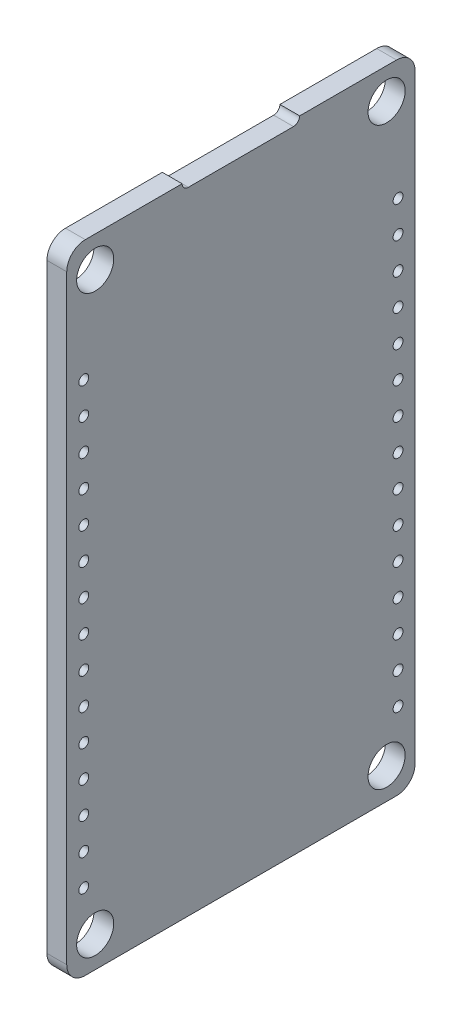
ISO-10303-21;
HEADER;
FILE_DESCRIPTION(('STEP AP214'),'2;1');
FILE_NAME('part.step','',(''),(''),'','','');
FILE_SCHEMA(('AUTOMOTIVE_DESIGN { 1 0 10303 214 1 1 1 1 }'));
ENDSEC;
DATA;
#1=APPLICATION_CONTEXT('core data for automotive mechanical design processes');
#2=APPLICATION_PROTOCOL_DEFINITION('international standard','automotive_design',2000,#1);
#3=PRODUCT_CONTEXT('',#1,'mechanical');
#4=PRODUCT('Part','Part','',(#3));
#5=PRODUCT_RELATED_PRODUCT_CATEGORY('part','',(#4));
#6=PRODUCT_DEFINITION_FORMATION('','',#4);
#7=PRODUCT_DEFINITION_CONTEXT('part definition',#1,'design');
#8=PRODUCT_DEFINITION('design','',#6,#7);
#9=PRODUCT_DEFINITION_SHAPE('','',#8);
#10=(LENGTH_UNIT() NAMED_UNIT(*) SI_UNIT(.MILLI.,.METRE.));
#11=(NAMED_UNIT(*) PLANE_ANGLE_UNIT() SI_UNIT($,.RADIAN.));
#12=(NAMED_UNIT(*) SI_UNIT($,.STERADIAN.) SOLID_ANGLE_UNIT());
#13=UNCERTAINTY_MEASURE_WITH_UNIT(LENGTH_MEASURE(1.E-05),#10,'distance_accuracy_value','');
#14=(GEOMETRIC_REPRESENTATION_CONTEXT(3) GLOBAL_UNCERTAINTY_ASSIGNED_CONTEXT((#13)) GLOBAL_UNIT_ASSIGNED_CONTEXT((#10,
#11,#12)) REPRESENTATION_CONTEXT('',''));
#15=CARTESIAN_POINT('',(0.,0.,0.));
#16=DIRECTION('',(0.,0.,1.));
#17=DIRECTION('',(1.,0.,0.));
#18=AXIS2_PLACEMENT_3D('',#15,#16,#17);
#19=CARTESIAN_POINT('',(1.6,0.,4.25));
#20=DIRECTION('',(1.,0.,0.));
#21=DIRECTION('',(0.,0.,-1.));
#22=AXIS2_PLACEMENT_3D('',#19,#20,#21);
#23=CYLINDRICAL_SURFACE('',#22,0.5);
#24=CARTESIAN_POINT('',(1.6,0.,4.25));
#25=DIRECTION('',(1.,0.,0.));
#26=DIRECTION('',(0.,0.,-1.));
#27=AXIS2_PLACEMENT_3D('',#24,#25,#26);
#28=CIRCLE('',#27,0.5);
#29=CARTESIAN_POINT('',(1.6,-0.5,4.25));
#30=VERTEX_POINT('',#29);
#31=CARTESIAN_POINT('',(1.6,0.,4.75));
#32=VERTEX_POINT('',#31);
#33=EDGE_CURVE('E102',#30,#32,#28,.F.);
#34=ORIENTED_EDGE('',*,*,#33,.F.);
#35=DIRECTION('',(1.,0.,0.));
#36=VECTOR('',#35,1.);
#37=CARTESIAN_POINT('',(1.6,-0.5,4.25));
#38=LINE('',#37,#36);
#39=CARTESIAN_POINT('',(0.,-0.5,4.25));
#40=VERTEX_POINT('',#39);
#41=EDGE_CURVE('E118',#30,#40,#38,.F.);
#42=ORIENTED_EDGE('',*,*,#41,.T.);
#43=CARTESIAN_POINT('',(0.,0.,4.25));
#44=DIRECTION('',(1.,0.,0.));
#45=DIRECTION('',(0.,0.,-1.));
#46=AXIS2_PLACEMENT_3D('',#43,#44,#45);
#47=CIRCLE('',#46,0.5);
#48=CARTESIAN_POINT('',(0.,0.,4.75));
#49=VERTEX_POINT('',#48);
#50=EDGE_CURVE('E20',#49,#40,#47,.T.);
#51=ORIENTED_EDGE('',*,*,#50,.F.);
#52=DIRECTION('',(1.,0.,0.));
#53=VECTOR('',#52,1.);
#54=CARTESIAN_POINT('',(0.,0.,4.75));
#55=LINE('',#54,#53);
#56=EDGE_CURVE('E116',#32,#49,#55,.F.);
#57=ORIENTED_EDGE('',*,*,#56,.F.);
#58=EDGE_LOOP('',(#34,#42,#51,#57));
#59=FACE_BOUND('',#58,.T.);
#60=ADVANCED_FACE('F17',(#59),#23,.F.);
#61=CARTESIAN_POINT('',(1.6,0.,-4.25));
#62=DIRECTION('',(1.,0.,0.));
#63=DIRECTION('',(0.,0.,-1.));
#64=AXIS2_PLACEMENT_3D('',#61,#62,#63);
#65=CYLINDRICAL_SURFACE('',#64,0.5);
#66=CARTESIAN_POINT('',(1.6,0.,-4.25));
#67=DIRECTION('',(1.,0.,0.));
#68=DIRECTION('',(0.,0.,-1.));
#69=AXIS2_PLACEMENT_3D('',#66,#67,#68);
#70=CIRCLE('',#69,0.5);
#71=CARTESIAN_POINT('',(1.6,0.,-4.75));
#72=VERTEX_POINT('',#71);
#73=CARTESIAN_POINT('',(1.6,-0.5,-4.25));
#74=VERTEX_POINT('',#73);
#75=EDGE_CURVE('E111',#72,#74,#70,.F.);
#76=ORIENTED_EDGE('',*,*,#75,.F.);
#77=DIRECTION('',(1.,0.,0.));
#78=VECTOR('',#77,1.);
#79=CARTESIAN_POINT('',(0.,0.,-4.75));
#80=LINE('',#79,#78);
#81=CARTESIAN_POINT('',(0.,0.,-4.75));
#82=VERTEX_POINT('',#81);
#83=EDGE_CURVE('E362',#82,#72,#80,.T.);
#84=ORIENTED_EDGE('',*,*,#83,.F.);
#85=CARTESIAN_POINT('',(0.,0.,-4.25));
#86=DIRECTION('',(1.,0.,0.));
#87=DIRECTION('',(0.,0.,-1.));
#88=AXIS2_PLACEMENT_3D('',#85,#86,#87);
#89=CIRCLE('',#88,0.5);
#90=CARTESIAN_POINT('',(0.,-0.5,-4.25));
#91=VERTEX_POINT('',#90);
#92=EDGE_CURVE('E35',#91,#82,#89,.T.);
#93=ORIENTED_EDGE('',*,*,#92,.F.);
#94=DIRECTION('',(1.,0.,0.));
#95=VECTOR('',#94,1.);
#96=CARTESIAN_POINT('',(1.6,-0.5,-4.25));
#97=LINE('',#96,#95);
#98=EDGE_CURVE('E126',#91,#74,#97,.T.);
#99=ORIENTED_EDGE('',*,*,#98,.T.);
#100=EDGE_LOOP('',(#76,#84,#93,#99));
#101=FACE_BOUND('',#100,.T.);
#102=ADVANCED_FACE('F372',(#101),#65,.F.);
#103=CARTESIAN_POINT('',(1.6,0.,0.));
#104=DIRECTION('',(1.,0.,0.));
#105=DIRECTION('',(0.,0.,-1.));
#106=AXIS2_PLACEMENT_3D('',#103,#104,#105);
#107=PLANE('',#106);
#108=CARTESIAN_POINT('',(1.6,-9.75,-12.7));
#109=DIRECTION('',(1.,0.,0.));
#110=DIRECTION('',(0.,0.,-1.));
#111=AXIS2_PLACEMENT_3D('',#108,#109,#110);
#112=CIRCLE('',#111,0.4);
#113=CARTESIAN_POINT('',(1.6,-9.75,-13.1));
#114=VERTEX_POINT('',#113);
#115=EDGE_CURVE('E259',#114,#114,#112,.F.);
#116=ORIENTED_EDGE('',*,*,#115,.T.);
#117=EDGE_LOOP('',(#116));
#118=FACE_BOUND('',#117,.T.);
#119=CARTESIAN_POINT('',(1.6,-49.,-11.775));
#120=DIRECTION('',(-1.,0.,0.));
#121=DIRECTION('',(0.,0.,1.));
#122=AXIS2_PLACEMENT_3D('',#119,#120,#121);
#123=CIRCLE('',#122,1.5);
#124=CARTESIAN_POINT('',(1.6,-49.,-10.275));
#125=VERTEX_POINT('',#124);
#126=EDGE_CURVE('E263',#125,#125,#123,.T.);
#127=ORIENTED_EDGE('',*,*,#126,.T.);
#128=EDGE_LOOP('',(#127));
#129=FACE_BOUND('',#128,.T.);
#130=CARTESIAN_POINT('',(1.6,-2.5,-11.775));
#131=DIRECTION('',(-1.,0.,0.));
#132=DIRECTION('',(0.,0.,1.));
#133=AXIS2_PLACEMENT_3D('',#130,#131,#132);
#134=CIRCLE('',#133,1.5);
#135=CARTESIAN_POINT('',(1.6,-2.5,-10.275));
#136=VERTEX_POINT('',#135);
#137=EDGE_CURVE('E266',#136,#136,#134,.T.);
#138=ORIENTED_EDGE('',*,*,#137,.T.);
#139=EDGE_LOOP('',(#138));
#140=FACE_BOUND('',#139,.T.);
#141=CARTESIAN_POINT('',(1.6,-49.,11.775));
#142=DIRECTION('',(-1.,0.,0.));
#143=DIRECTION('',(0.,0.,1.));
#144=AXIS2_PLACEMENT_3D('',#141,#142,#143);
#145=CIRCLE('',#144,1.5);
#146=CARTESIAN_POINT('',(1.6,-49.,13.275));
#147=VERTEX_POINT('',#146);
#148=EDGE_CURVE('E269',#147,#147,#145,.T.);
#149=ORIENTED_EDGE('',*,*,#148,.T.);
#150=EDGE_LOOP('',(#149));
#151=FACE_BOUND('',#150,.T.);
#152=CARTESIAN_POINT('',(1.6,-2.5,11.775));
#153=DIRECTION('',(-1.,0.,0.));
#154=DIRECTION('',(0.,0.,1.));
#155=AXIS2_PLACEMENT_3D('',#152,#153,#154);
#156=CIRCLE('',#155,1.5);
#157=CARTESIAN_POINT('',(1.6,-2.5,13.275));
#158=VERTEX_POINT('',#157);
#159=EDGE_CURVE('E272',#158,#158,#156,.T.);
#160=ORIENTED_EDGE('',*,*,#159,.T.);
#161=EDGE_LOOP('',(#160));
#162=FACE_BOUND('',#161,.T.);
#163=CARTESIAN_POINT('',(1.6,-45.31,12.7));
#164=DIRECTION('',(1.,0.,0.));
#165=DIRECTION('',(0.,0.,-1.));
#166=AXIS2_PLACEMENT_3D('',#163,#164,#165);
#167=CIRCLE('',#166,0.4);
#168=CARTESIAN_POINT('',(1.6,-45.31,12.3));
#169=VERTEX_POINT('',#168);
#170=EDGE_CURVE('E275',#169,#169,#167,.F.);
#171=ORIENTED_EDGE('',*,*,#170,.T.);
#172=EDGE_LOOP('',(#171));
#173=FACE_BOUND('',#172,.T.);
#174=CARTESIAN_POINT('',(1.6,-45.31,-12.7));
#175=DIRECTION('',(1.,0.,0.));
#176=DIRECTION('',(0.,0.,-1.));
#177=AXIS2_PLACEMENT_3D('',#174,#175,#176);
#178=CIRCLE('',#177,0.4);
#179=CARTESIAN_POINT('',(1.6,-45.31,-13.1));
#180=VERTEX_POINT('',#179);
#181=EDGE_CURVE('E278',#180,#180,#178,.F.);
#182=ORIENTED_EDGE('',*,*,#181,.T.);
#183=EDGE_LOOP('',(#182));
#184=FACE_BOUND('',#183,.T.);
#185=CARTESIAN_POINT('',(1.6,-42.77,12.7));
#186=DIRECTION('',(1.,0.,0.));
#187=DIRECTION('',(0.,0.,-1.));
#188=AXIS2_PLACEMENT_3D('',#185,#186,#187);
#189=CIRCLE('',#188,0.4);
#190=CARTESIAN_POINT('',(1.6,-42.77,12.3));
#191=VERTEX_POINT('',#190);
#192=EDGE_CURVE('E281',#191,#191,#189,.F.);
#193=ORIENTED_EDGE('',*,*,#192,.T.);
#194=EDGE_LOOP('',(#193));
#195=FACE_BOUND('',#194,.T.);
#196=CARTESIAN_POINT('',(1.6,-42.77,-12.7));
#197=DIRECTION('',(1.,0.,0.));
#198=DIRECTION('',(0.,0.,-1.));
#199=AXIS2_PLACEMENT_3D('',#196,#197,#198);
#200=CIRCLE('',#199,0.4);
#201=CARTESIAN_POINT('',(1.6,-42.77,-13.1));
#202=VERTEX_POINT('',#201);
#203=EDGE_CURVE('E284',#202,#202,#200,.F.);
#204=ORIENTED_EDGE('',*,*,#203,.T.);
#205=EDGE_LOOP('',(#204));
#206=FACE_BOUND('',#205,.T.);
#207=CARTESIAN_POINT('',(1.6,-40.23,12.7));
#208=DIRECTION('',(1.,0.,0.));
#209=DIRECTION('',(0.,0.,-1.));
#210=AXIS2_PLACEMENT_3D('',#207,#208,#209);
#211=CIRCLE('',#210,0.4);
#212=CARTESIAN_POINT('',(1.6,-40.23,12.3));
#213=VERTEX_POINT('',#212);
#214=EDGE_CURVE('E287',#213,#213,#211,.F.);
#215=ORIENTED_EDGE('',*,*,#214,.T.);
#216=EDGE_LOOP('',(#215));
#217=FACE_BOUND('',#216,.T.);
#218=CARTESIAN_POINT('',(1.6,-40.23,-12.7));
#219=DIRECTION('',(1.,0.,0.));
#220=DIRECTION('',(0.,0.,-1.));
#221=AXIS2_PLACEMENT_3D('',#218,#219,#220);
#222=CIRCLE('',#221,0.4);
#223=CARTESIAN_POINT('',(1.6,-40.23,-13.1));
#224=VERTEX_POINT('',#223);
#225=EDGE_CURVE('E290',#224,#224,#222,.F.);
#226=ORIENTED_EDGE('',*,*,#225,.T.);
#227=EDGE_LOOP('',(#226));
#228=FACE_BOUND('',#227,.T.);
#229=CARTESIAN_POINT('',(1.6,-37.69,12.7));
#230=DIRECTION('',(1.,0.,0.));
#231=DIRECTION('',(0.,0.,-1.));
#232=AXIS2_PLACEMENT_3D('',#229,#230,#231);
#233=CIRCLE('',#232,0.4);
#234=CARTESIAN_POINT('',(1.6,-37.69,12.3));
#235=VERTEX_POINT('',#234);
#236=EDGE_CURVE('E293',#235,#235,#233,.F.);
#237=ORIENTED_EDGE('',*,*,#236,.T.);
#238=EDGE_LOOP('',(#237));
#239=FACE_BOUND('',#238,.T.);
#240=CARTESIAN_POINT('',(1.6,-37.69,-12.7));
#241=DIRECTION('',(1.,0.,0.));
#242=DIRECTION('',(0.,0.,-1.));
#243=AXIS2_PLACEMENT_3D('',#240,#241,#242);
#244=CIRCLE('',#243,0.4);
#245=CARTESIAN_POINT('',(1.6,-37.69,-13.1));
#246=VERTEX_POINT('',#245);
#247=EDGE_CURVE('E296',#246,#246,#244,.F.);
#248=ORIENTED_EDGE('',*,*,#247,.T.);
#249=EDGE_LOOP('',(#248));
#250=FACE_BOUND('',#249,.T.);
#251=CARTESIAN_POINT('',(1.6,-35.15,12.7));
#252=DIRECTION('',(1.,0.,0.));
#253=DIRECTION('',(0.,0.,-1.));
#254=AXIS2_PLACEMENT_3D('',#251,#252,#253);
#255=CIRCLE('',#254,0.4);
#256=CARTESIAN_POINT('',(1.6,-35.15,12.3));
#257=VERTEX_POINT('',#256);
#258=EDGE_CURVE('E299',#257,#257,#255,.F.);
#259=ORIENTED_EDGE('',*,*,#258,.T.);
#260=EDGE_LOOP('',(#259));
#261=FACE_BOUND('',#260,.T.);
#262=CARTESIAN_POINT('',(1.6,-35.15,-12.7));
#263=DIRECTION('',(1.,0.,0.));
#264=DIRECTION('',(0.,0.,-1.));
#265=AXIS2_PLACEMENT_3D('',#262,#263,#264);
#266=CIRCLE('',#265,0.4);
#267=CARTESIAN_POINT('',(1.6,-35.15,-13.1));
#268=VERTEX_POINT('',#267);
#269=EDGE_CURVE('E302',#268,#268,#266,.F.);
#270=ORIENTED_EDGE('',*,*,#269,.T.);
#271=EDGE_LOOP('',(#270));
#272=FACE_BOUND('',#271,.T.);
#273=CARTESIAN_POINT('',(1.6,-32.61,12.7));
#274=DIRECTION('',(1.,0.,0.));
#275=DIRECTION('',(0.,0.,-1.));
#276=AXIS2_PLACEMENT_3D('',#273,#274,#275);
#277=CIRCLE('',#276,0.4);
#278=CARTESIAN_POINT('',(1.6,-32.61,12.3));
#279=VERTEX_POINT('',#278);
#280=EDGE_CURVE('E305',#279,#279,#277,.F.);
#281=ORIENTED_EDGE('',*,*,#280,.T.);
#282=EDGE_LOOP('',(#281));
#283=FACE_BOUND('',#282,.T.);
#284=CARTESIAN_POINT('',(1.6,-32.61,-12.7));
#285=DIRECTION('',(1.,0.,0.));
#286=DIRECTION('',(0.,0.,-1.));
#287=AXIS2_PLACEMENT_3D('',#284,#285,#286);
#288=CIRCLE('',#287,0.4);
#289=CARTESIAN_POINT('',(1.6,-32.61,-13.1));
#290=VERTEX_POINT('',#289);
#291=EDGE_CURVE('E308',#290,#290,#288,.F.);
#292=ORIENTED_EDGE('',*,*,#291,.T.);
#293=EDGE_LOOP('',(#292));
#294=FACE_BOUND('',#293,.T.);
#295=CARTESIAN_POINT('',(1.6,-30.07,12.7));
#296=DIRECTION('',(1.,0.,0.));
#297=DIRECTION('',(0.,0.,-1.));
#298=AXIS2_PLACEMENT_3D('',#295,#296,#297);
#299=CIRCLE('',#298,0.4);
#300=CARTESIAN_POINT('',(1.6,-30.07,12.3));
#301=VERTEX_POINT('',#300);
#302=EDGE_CURVE('E311',#301,#301,#299,.F.);
#303=ORIENTED_EDGE('',*,*,#302,.T.);
#304=EDGE_LOOP('',(#303));
#305=FACE_BOUND('',#304,.T.);
#306=CARTESIAN_POINT('',(1.6,-30.07,-12.7));
#307=DIRECTION('',(1.,0.,0.));
#308=DIRECTION('',(0.,0.,-1.));
#309=AXIS2_PLACEMENT_3D('',#306,#307,#308);
#310=CIRCLE('',#309,0.4);
#311=CARTESIAN_POINT('',(1.6,-30.07,-13.1));
#312=VERTEX_POINT('',#311);
#313=EDGE_CURVE('E314',#312,#312,#310,.F.);
#314=ORIENTED_EDGE('',*,*,#313,.T.);
#315=EDGE_LOOP('',(#314));
#316=FACE_BOUND('',#315,.T.);
#317=CARTESIAN_POINT('',(1.6,-27.53,12.7));
#318=DIRECTION('',(1.,0.,0.));
#319=DIRECTION('',(0.,0.,-1.));
#320=AXIS2_PLACEMENT_3D('',#317,#318,#319);
#321=CIRCLE('',#320,0.4);
#322=CARTESIAN_POINT('',(1.6,-27.53,12.3));
#323=VERTEX_POINT('',#322);
#324=EDGE_CURVE('E317',#323,#323,#321,.F.);
#325=ORIENTED_EDGE('',*,*,#324,.T.);
#326=EDGE_LOOP('',(#325));
#327=FACE_BOUND('',#326,.T.);
#328=CARTESIAN_POINT('',(1.6,-27.53,-12.7));
#329=DIRECTION('',(1.,0.,0.));
#330=DIRECTION('',(0.,0.,-1.));
#331=AXIS2_PLACEMENT_3D('',#328,#329,#330);
#332=CIRCLE('',#331,0.4);
#333=CARTESIAN_POINT('',(1.6,-27.53,-13.1));
#334=VERTEX_POINT('',#333);
#335=EDGE_CURVE('E320',#334,#334,#332,.F.);
#336=ORIENTED_EDGE('',*,*,#335,.T.);
#337=EDGE_LOOP('',(#336));
#338=FACE_BOUND('',#337,.T.);
#339=CARTESIAN_POINT('',(1.6,-24.99,12.7));
#340=DIRECTION('',(1.,0.,0.));
#341=DIRECTION('',(0.,0.,-1.));
#342=AXIS2_PLACEMENT_3D('',#339,#340,#341);
#343=CIRCLE('',#342,0.4);
#344=CARTESIAN_POINT('',(1.6,-24.99,12.3));
#345=VERTEX_POINT('',#344);
#346=EDGE_CURVE('E323',#345,#345,#343,.F.);
#347=ORIENTED_EDGE('',*,*,#346,.T.);
#348=EDGE_LOOP('',(#347));
#349=FACE_BOUND('',#348,.T.);
#350=CARTESIAN_POINT('',(1.6,-24.99,-12.7));
#351=DIRECTION('',(1.,0.,0.));
#352=DIRECTION('',(0.,0.,-1.));
#353=AXIS2_PLACEMENT_3D('',#350,#351,#352);
#354=CIRCLE('',#353,0.4);
#355=CARTESIAN_POINT('',(1.6,-24.99,-13.1));
#356=VERTEX_POINT('',#355);
#357=EDGE_CURVE('E326',#356,#356,#354,.F.);
#358=ORIENTED_EDGE('',*,*,#357,.T.);
#359=EDGE_LOOP('',(#358));
#360=FACE_BOUND('',#359,.T.);
#361=CARTESIAN_POINT('',(1.6,-22.45,12.7));
#362=DIRECTION('',(1.,0.,0.));
#363=DIRECTION('',(0.,0.,-1.));
#364=AXIS2_PLACEMENT_3D('',#361,#362,#363);
#365=CIRCLE('',#364,0.4);
#366=CARTESIAN_POINT('',(1.6,-22.45,12.3));
#367=VERTEX_POINT('',#366);
#368=EDGE_CURVE('E329',#367,#367,#365,.F.);
#369=ORIENTED_EDGE('',*,*,#368,.T.);
#370=EDGE_LOOP('',(#369));
#371=FACE_BOUND('',#370,.T.);
#372=CARTESIAN_POINT('',(1.6,-22.45,-12.7));
#373=DIRECTION('',(1.,0.,0.));
#374=DIRECTION('',(0.,0.,-1.));
#375=AXIS2_PLACEMENT_3D('',#372,#373,#374);
#376=CIRCLE('',#375,0.4);
#377=CARTESIAN_POINT('',(1.6,-22.45,-13.1));
#378=VERTEX_POINT('',#377);
#379=EDGE_CURVE('E332',#378,#378,#376,.F.);
#380=ORIENTED_EDGE('',*,*,#379,.T.);
#381=EDGE_LOOP('',(#380));
#382=FACE_BOUND('',#381,.T.);
#383=CARTESIAN_POINT('',(1.6,-19.91,12.7));
#384=DIRECTION('',(1.,0.,0.));
#385=DIRECTION('',(0.,0.,-1.));
#386=AXIS2_PLACEMENT_3D('',#383,#384,#385);
#387=CIRCLE('',#386,0.4);
#388=CARTESIAN_POINT('',(1.6,-19.91,12.3));
#389=VERTEX_POINT('',#388);
#390=EDGE_CURVE('E335',#389,#389,#387,.F.);
#391=ORIENTED_EDGE('',*,*,#390,.T.);
#392=EDGE_LOOP('',(#391));
#393=FACE_BOUND('',#392,.T.);
#394=CARTESIAN_POINT('',(1.6,-19.91,-12.7));
#395=DIRECTION('',(1.,0.,0.));
#396=DIRECTION('',(0.,0.,-1.));
#397=AXIS2_PLACEMENT_3D('',#394,#395,#396);
#398=CIRCLE('',#397,0.4);
#399=CARTESIAN_POINT('',(1.6,-19.91,-13.1));
#400=VERTEX_POINT('',#399);
#401=EDGE_CURVE('E338',#400,#400,#398,.F.);
#402=ORIENTED_EDGE('',*,*,#401,.T.);
#403=EDGE_LOOP('',(#402));
#404=FACE_BOUND('',#403,.T.);
#405=CARTESIAN_POINT('',(1.6,-17.37,12.7));
#406=DIRECTION('',(1.,0.,0.));
#407=DIRECTION('',(0.,0.,-1.));
#408=AXIS2_PLACEMENT_3D('',#405,#406,#407);
#409=CIRCLE('',#408,0.4);
#410=CARTESIAN_POINT('',(1.6,-17.37,12.3));
#411=VERTEX_POINT('',#410);
#412=EDGE_CURVE('E341',#411,#411,#409,.F.);
#413=ORIENTED_EDGE('',*,*,#412,.T.);
#414=EDGE_LOOP('',(#413));
#415=FACE_BOUND('',#414,.T.);
#416=CARTESIAN_POINT('',(1.6,-17.37,-12.7));
#417=DIRECTION('',(1.,0.,0.));
#418=DIRECTION('',(0.,0.,-1.));
#419=AXIS2_PLACEMENT_3D('',#416,#417,#418);
#420=CIRCLE('',#419,0.4);
#421=CARTESIAN_POINT('',(1.6,-17.37,-13.1));
#422=VERTEX_POINT('',#421);
#423=EDGE_CURVE('E344',#422,#422,#420,.F.);
#424=ORIENTED_EDGE('',*,*,#423,.T.);
#425=EDGE_LOOP('',(#424));
#426=FACE_BOUND('',#425,.T.);
#427=CARTESIAN_POINT('',(1.6,-14.83,12.7));
#428=DIRECTION('',(1.,0.,0.));
#429=DIRECTION('',(0.,0.,-1.));
#430=AXIS2_PLACEMENT_3D('',#427,#428,#429);
#431=CIRCLE('',#430,0.4);
#432=CARTESIAN_POINT('',(1.6,-14.83,12.3));
#433=VERTEX_POINT('',#432);
#434=EDGE_CURVE('E347',#433,#433,#431,.F.);
#435=ORIENTED_EDGE('',*,*,#434,.T.);
#436=EDGE_LOOP('',(#435));
#437=FACE_BOUND('',#436,.T.);
#438=CARTESIAN_POINT('',(1.6,-14.83,-12.7));
#439=DIRECTION('',(1.,0.,0.));
#440=DIRECTION('',(0.,0.,-1.));
#441=AXIS2_PLACEMENT_3D('',#438,#439,#440);
#442=CIRCLE('',#441,0.4);
#443=CARTESIAN_POINT('',(1.6,-14.83,-13.1));
#444=VERTEX_POINT('',#443);
#445=EDGE_CURVE('E350',#444,#444,#442,.F.);
#446=ORIENTED_EDGE('',*,*,#445,.T.);
#447=EDGE_LOOP('',(#446));
#448=FACE_BOUND('',#447,.T.);
#449=CARTESIAN_POINT('',(1.6,-12.29,12.7));
#450=DIRECTION('',(1.,0.,0.));
#451=DIRECTION('',(0.,0.,-1.));
#452=AXIS2_PLACEMENT_3D('',#449,#450,#451);
#453=CIRCLE('',#452,0.4);
#454=CARTESIAN_POINT('',(1.6,-12.29,12.3));
#455=VERTEX_POINT('',#454);
#456=EDGE_CURVE('E353',#455,#455,#453,.F.);
#457=ORIENTED_EDGE('',*,*,#456,.T.);
#458=EDGE_LOOP('',(#457));
#459=FACE_BOUND('',#458,.T.);
#460=CARTESIAN_POINT('',(1.6,-12.29,-12.7));
#461=DIRECTION('',(1.,0.,0.));
#462=DIRECTION('',(0.,0.,-1.));
#463=AXIS2_PLACEMENT_3D('',#460,#461,#462);
#464=CIRCLE('',#463,0.4);
#465=CARTESIAN_POINT('',(1.6,-12.29,-13.1));
#466=VERTEX_POINT('',#465);
#467=EDGE_CURVE('E356',#466,#466,#464,.F.);
#468=ORIENTED_EDGE('',*,*,#467,.T.);
#469=EDGE_LOOP('',(#468));
#470=FACE_BOUND('',#469,.T.);
#471=CARTESIAN_POINT('',(1.6,-9.75,12.7));
#472=DIRECTION('',(1.,0.,0.));
#473=DIRECTION('',(0.,0.,-1.));
#474=AXIS2_PLACEMENT_3D('',#471,#472,#473);
#475=CIRCLE('',#474,0.4);
#476=CARTESIAN_POINT('',(1.6,-9.75,12.3));
#477=VERTEX_POINT('',#476);
#478=EDGE_CURVE('E359',#477,#477,#475,.F.);
#479=ORIENTED_EDGE('',*,*,#478,.T.);
#480=EDGE_LOOP('',(#479));
#481=FACE_BOUND('',#480,.T.);
#482=ORIENTED_EDGE('',*,*,#75,.T.);
#483=DIRECTION('',(0.,0.,-1.));
#484=VECTOR('',#483,1.);
#485=CARTESIAN_POINT('',(1.6,-0.5,4.25));
#486=LINE('',#485,#484);
#487=EDGE_CURVE('E109',#74,#30,#486,.F.);
#488=ORIENTED_EDGE('',*,*,#487,.T.);
#489=ORIENTED_EDGE('',*,*,#33,.T.);
#490=DIRECTION('',(0.,0.,1.));
#491=VECTOR('',#490,1.);
#492=CARTESIAN_POINT('',(1.6,0.,-14.075));
#493=LINE('',#492,#491);
#494=CARTESIAN_POINT('',(1.6,0.,12.575));
#495=VERTEX_POINT('',#494);
#496=EDGE_CURVE('E106',#495,#32,#493,.F.);
#497=ORIENTED_EDGE('',*,*,#496,.F.);
#498=CARTESIAN_POINT('',(1.6,-1.5,12.575));
#499=DIRECTION('',(-1.,0.,0.));
#500=DIRECTION('',(0.,0.,1.));
#501=AXIS2_PLACEMENT_3D('',#498,#499,#500);
#502=CIRCLE('',#501,1.5);
#503=CARTESIAN_POINT('',(1.6,-1.5,14.075));
#504=VERTEX_POINT('',#503);
#505=EDGE_CURVE('E120',#504,#495,#502,.T.);
#506=ORIENTED_EDGE('',*,*,#505,.F.);
#507=DIRECTION('',(0.,1.,0.));
#508=VECTOR('',#507,1.);
#509=CARTESIAN_POINT('',(1.6,0.,14.075));
#510=LINE('',#509,#508);
#511=CARTESIAN_POINT('',(1.6,-50.,14.075));
#512=VERTEX_POINT('',#511);
#513=EDGE_CURVE('E140',#512,#504,#510,.T.);
#514=ORIENTED_EDGE('',*,*,#513,.F.);
#515=CARTESIAN_POINT('',(1.6,-50.,12.575));
#516=DIRECTION('',(-1.,0.,0.));
#517=DIRECTION('',(0.,0.,1.));
#518=AXIS2_PLACEMENT_3D('',#515,#516,#517);
#519=CIRCLE('',#518,1.5);
#520=CARTESIAN_POINT('',(1.6,-51.5,12.575));
#521=VERTEX_POINT('',#520);
#522=EDGE_CURVE('E367',#521,#512,#519,.T.);
#523=ORIENTED_EDGE('',*,*,#522,.F.);
#524=DIRECTION('',(0.,0.,-1.));
#525=VECTOR('',#524,1.);
#526=CARTESIAN_POINT('',(1.6,-51.5,14.075));
#527=LINE('',#526,#525);
#528=CARTESIAN_POINT('',(1.6,-51.5,-12.575));
#529=VERTEX_POINT('',#528);
#530=EDGE_CURVE('E136',#529,#521,#527,.F.);
#531=ORIENTED_EDGE('',*,*,#530,.F.);
#532=CARTESIAN_POINT('',(1.6,-50.,-12.575));
#533=DIRECTION('',(-1.,0.,0.));
#534=DIRECTION('',(0.,0.,1.));
#535=AXIS2_PLACEMENT_3D('',#532,#533,#534);
#536=CIRCLE('',#535,1.5);
#537=CARTESIAN_POINT('',(1.6,-50.,-14.075));
#538=VERTEX_POINT('',#537);
#539=EDGE_CURVE('E365',#538,#529,#536,.T.);
#540=ORIENTED_EDGE('',*,*,#539,.F.);
#541=DIRECTION('',(0.,1.,0.));
#542=VECTOR('',#541,1.);
#543=CARTESIAN_POINT('',(1.6,-51.5,-14.075));
#544=LINE('',#543,#542);
#545=CARTESIAN_POINT('',(1.6,-1.5,-14.075));
#546=VERTEX_POINT('',#545);
#547=EDGE_CURVE('E132',#546,#538,#544,.F.);
#548=ORIENTED_EDGE('',*,*,#547,.F.);
#549=CARTESIAN_POINT('',(1.6,-1.5,-12.575));
#550=DIRECTION('',(-1.,0.,0.));
#551=DIRECTION('',(0.,0.,1.));
#552=AXIS2_PLACEMENT_3D('',#549,#550,#551);
#553=CIRCLE('',#552,1.5);
#554=CARTESIAN_POINT('',(1.6,0.,-12.575));
#555=VERTEX_POINT('',#554);
#556=EDGE_CURVE('E363',#555,#546,#553,.T.);
#557=ORIENTED_EDGE('',*,*,#556,.F.);
#558=DIRECTION('',(0.,0.,1.));
#559=VECTOR('',#558,1.);
#560=CARTESIAN_POINT('',(1.6,0.,-14.075));
#561=LINE('',#560,#559);
#562=EDGE_CURVE('E65',#72,#555,#561,.F.);
#563=ORIENTED_EDGE('',*,*,#562,.F.);
#564=EDGE_LOOP('',(#482,#488,#489,#497,#506,#514,#523,#531,#540,#548,#557,#563));
#565=FACE_BOUND('',#564,.T.);
#566=ADVANCED_FACE('F104',(#118,#129,#140,#151,#162,#173,#184,#195,#206,#217,#228,#239,#250,
#261,#272,#283,#294,#305,#316,#327,#338,#349,#360,#371,#382,#393,#404,#415,#426,#437,#448,#459,
#470,#481,#565),#107,.T.);
#567=CARTESIAN_POINT('',(1.6,-0.5,4.25));
#568=DIRECTION('',(0.,-1.,0.));
#569=DIRECTION('',(0.,0.,-1.));
#570=AXIS2_PLACEMENT_3D('',#567,#568,#569);
#571=PLANE('',#570);
#572=ORIENTED_EDGE('',*,*,#487,.F.);
#573=ORIENTED_EDGE('',*,*,#98,.F.);
#574=DIRECTION('',(0.,0.,-1.));
#575=VECTOR('',#574,1.);
#576=CARTESIAN_POINT('',(0.,-0.5,0.));
#577=LINE('',#576,#575);
#578=EDGE_CURVE('E262',#91,#40,#577,.F.);
#579=ORIENTED_EDGE('',*,*,#578,.T.);
#580=ORIENTED_EDGE('',*,*,#41,.F.);
#581=EDGE_LOOP('',(#572,#573,#579,#580));
#582=FACE_BOUND('',#581,.T.);
#583=ADVANCED_FACE('F370',(#582),#571,.F.);
#584=CARTESIAN_POINT('',(0.,0.,-14.075));
#585=DIRECTION('',(0.,1.,0.));
#586=DIRECTION('',(0.,0.,1.));
#587=AXIS2_PLACEMENT_3D('',#584,#585,#586);
#588=PLANE('',#587);
#589=ORIENTED_EDGE('',*,*,#496,.T.);
#590=ORIENTED_EDGE('',*,*,#56,.T.);
#591=DIRECTION('',(0.,0.,-1.));
#592=VECTOR('',#591,1.);
#593=CARTESIAN_POINT('',(0.,0.,0.));
#594=LINE('',#593,#592);
#595=CARTESIAN_POINT('',(0.,0.,12.575));
#596=VERTEX_POINT('',#595);
#597=EDGE_CURVE('E258',#49,#596,#594,.F.);
#598=ORIENTED_EDGE('',*,*,#597,.T.);
#599=DIRECTION('',(-1.,0.,0.));
#600=VECTOR('',#599,1.);
#601=CARTESIAN_POINT('',(3.68576,0.,12.575));
#602=LINE('',#601,#600);
#603=EDGE_CURVE('E117',#495,#596,#602,.T.);
#604=ORIENTED_EDGE('',*,*,#603,.F.);
#605=EDGE_LOOP('',(#589,#590,#598,#604));
#606=FACE_BOUND('',#605,.T.);
#607=ADVANCED_FACE('F114',(#606),#588,.T.);
#608=CARTESIAN_POINT('',(3.68576,-1.5,12.575));
#609=DIRECTION('',(-1.,0.,0.));
#610=DIRECTION('',(0.,0.,1.));
#611=AXIS2_PLACEMENT_3D('',#608,#609,#610);
#612=CYLINDRICAL_SURFACE('',#611,1.5);
#613=ORIENTED_EDGE('',*,*,#603,.T.);
#614=CARTESIAN_POINT('',(0.,-1.5,12.575));
#615=DIRECTION('',(-1.,0.,0.));
#616=DIRECTION('',(0.,0.,1.));
#617=AXIS2_PLACEMENT_3D('',#614,#615,#616);
#618=CIRCLE('',#617,1.5);
#619=CARTESIAN_POINT('',(0.,-1.5,14.075));
#620=VERTEX_POINT('',#619);
#621=EDGE_CURVE('E255',#596,#620,#618,.F.);
#622=ORIENTED_EDGE('',*,*,#621,.T.);
#623=DIRECTION('',(1.,0.,0.));
#624=VECTOR('',#623,1.);
#625=CARTESIAN_POINT('',(0.,-1.5,14.075));
#626=LINE('',#625,#624);
#627=EDGE_CURVE('E141',#504,#620,#626,.F.);
#628=ORIENTED_EDGE('',*,*,#627,.F.);
#629=ORIENTED_EDGE('',*,*,#505,.T.);
#630=EDGE_LOOP('',(#613,#622,#628,#629));
#631=FACE_BOUND('',#630,.T.);
#632=ADVANCED_FACE('F552',(#631),#612,.T.);
#633=CARTESIAN_POINT('',(0.,0.,14.075));
#634=DIRECTION('',(0.,0.,1.));
#635=DIRECTION('',(1.,0.,0.));
#636=AXIS2_PLACEMENT_3D('',#633,#634,#635);
#637=PLANE('',#636);
#638=ORIENTED_EDGE('',*,*,#513,.T.);
#639=ORIENTED_EDGE('',*,*,#627,.T.);
#640=DIRECTION('',(0.,1.,0.));
#641=VECTOR('',#640,1.);
#642=CARTESIAN_POINT('',(0.,0.,14.075));
#643=LINE('',#642,#641);
#644=CARTESIAN_POINT('',(0.,-50.,14.075));
#645=VERTEX_POINT('',#644);
#646=EDGE_CURVE('E254',#620,#645,#643,.F.);
#647=ORIENTED_EDGE('',*,*,#646,.T.);
#648=DIRECTION('',(-1.,0.,0.));
#649=VECTOR('',#648,1.);
#650=CARTESIAN_POINT('',(3.68576,-50.,14.075));
#651=LINE('',#650,#649);
#652=EDGE_CURVE('E139',#512,#645,#651,.T.);
#653=ORIENTED_EDGE('',*,*,#652,.F.);
#654=EDGE_LOOP('',(#638,#639,#647,#653));
#655=FACE_BOUND('',#654,.T.);
#656=ADVANCED_FACE('F548',(#655),#637,.T.);
#657=CARTESIAN_POINT('',(3.68576,-50.,12.575));
#658=DIRECTION('',(-1.,0.,0.));
#659=DIRECTION('',(0.,0.,1.));
#660=AXIS2_PLACEMENT_3D('',#657,#658,#659);
#661=CYLINDRICAL_SURFACE('',#660,1.5);
#662=ORIENTED_EDGE('',*,*,#652,.T.);
#663=CARTESIAN_POINT('',(0.,-50.,12.575));
#664=DIRECTION('',(-1.,0.,0.));
#665=DIRECTION('',(0.,0.,1.));
#666=AXIS2_PLACEMENT_3D('',#663,#664,#665);
#667=CIRCLE('',#666,1.5);
#668=CARTESIAN_POINT('',(0.,-51.5,12.575));
#669=VERTEX_POINT('',#668);
#670=EDGE_CURVE('E251',#645,#669,#667,.F.);
#671=ORIENTED_EDGE('',*,*,#670,.T.);
#672=DIRECTION('',(1.,0.,0.));
#673=VECTOR('',#672,1.);
#674=CARTESIAN_POINT('',(0.,-51.5,12.575));
#675=LINE('',#674,#673);
#676=EDGE_CURVE('E138',#521,#669,#675,.F.);
#677=ORIENTED_EDGE('',*,*,#676,.F.);
#678=ORIENTED_EDGE('',*,*,#522,.T.);
#679=EDGE_LOOP('',(#662,#671,#677,#678));
#680=FACE_BOUND('',#679,.T.);
#681=ADVANCED_FACE('F544',(#680),#661,.T.);
#682=CARTESIAN_POINT('',(0.,-51.5,14.075));
#683=DIRECTION('',(0.,-1.,0.));
#684=DIRECTION('',(0.,0.,-1.));
#685=AXIS2_PLACEMENT_3D('',#682,#683,#684);
#686=PLANE('',#685);
#687=ORIENTED_EDGE('',*,*,#530,.T.);
#688=ORIENTED_EDGE('',*,*,#676,.T.);
#689=DIRECTION('',(0.,0.,-1.));
#690=VECTOR('',#689,1.);
#691=CARTESIAN_POINT('',(0.,-51.5,0.));
#692=LINE('',#691,#690);
#693=CARTESIAN_POINT('',(0.,-51.5,-12.575));
#694=VERTEX_POINT('',#693);
#695=EDGE_CURVE('E250',#669,#694,#692,.T.);
#696=ORIENTED_EDGE('',*,*,#695,.T.);
#697=DIRECTION('',(-1.,0.,0.));
#698=VECTOR('',#697,1.);
#699=CARTESIAN_POINT('',(3.68576,-51.5,-12.575));
#700=LINE('',#699,#698);
#701=EDGE_CURVE('E135',#529,#694,#700,.T.);
#702=ORIENTED_EDGE('',*,*,#701,.F.);
#703=EDGE_LOOP('',(#687,#688,#696,#702));
#704=FACE_BOUND('',#703,.T.);
#705=ADVANCED_FACE('F540',(#704),#686,.T.);
#706=CARTESIAN_POINT('',(3.68576,-50.,-12.575));
#707=DIRECTION('',(-1.,0.,0.));
#708=DIRECTION('',(0.,0.,1.));
#709=AXIS2_PLACEMENT_3D('',#706,#707,#708);
#710=CYLINDRICAL_SURFACE('',#709,1.5);
#711=ORIENTED_EDGE('',*,*,#701,.T.);
#712=CARTESIAN_POINT('',(0.,-50.,-12.575));
#713=DIRECTION('',(-1.,0.,0.));
#714=DIRECTION('',(0.,0.,1.));
#715=AXIS2_PLACEMENT_3D('',#712,#713,#714);
#716=CIRCLE('',#715,1.5);
#717=CARTESIAN_POINT('',(0.,-50.,-14.075));
#718=VERTEX_POINT('',#717);
#719=EDGE_CURVE('E247',#694,#718,#716,.F.);
#720=ORIENTED_EDGE('',*,*,#719,.T.);
#721=DIRECTION('',(-1.,0.,0.));
#722=VECTOR('',#721,1.);
#723=CARTESIAN_POINT('',(0.,-50.,-14.075));
#724=LINE('',#723,#722);
#725=EDGE_CURVE('E134',#538,#718,#724,.T.);
#726=ORIENTED_EDGE('',*,*,#725,.F.);
#727=ORIENTED_EDGE('',*,*,#539,.T.);
#728=EDGE_LOOP('',(#711,#720,#726,#727));
#729=FACE_BOUND('',#728,.T.);
#730=ADVANCED_FACE('F536',(#729),#710,.T.);
#731=CARTESIAN_POINT('',(0.,-51.5,-14.075));
#732=DIRECTION('',(0.,0.,-1.));
#733=DIRECTION('',(-1.,0.,0.));
#734=AXIS2_PLACEMENT_3D('',#731,#732,#733);
#735=PLANE('',#734);
#736=DIRECTION('',(0.,1.,0.));
#737=VECTOR('',#736,1.);
#738=CARTESIAN_POINT('',(0.,0.,-14.075));
#739=LINE('',#738,#737);
#740=CARTESIAN_POINT('',(0.,-1.5,-14.075));
#741=VERTEX_POINT('',#740);
#742=EDGE_CURVE('E246',#718,#741,#739,.T.);
#743=ORIENTED_EDGE('',*,*,#742,.T.);
#744=DIRECTION('',(-1.,0.,0.));
#745=VECTOR('',#744,1.);
#746=CARTESIAN_POINT('',(3.68576,-1.5,-14.075));
#747=LINE('',#746,#745);
#748=EDGE_CURVE('E131',#546,#741,#747,.T.);
#749=ORIENTED_EDGE('',*,*,#748,.F.);
#750=ORIENTED_EDGE('',*,*,#547,.T.);
#751=ORIENTED_EDGE('',*,*,#725,.T.);
#752=EDGE_LOOP('',(#743,#749,#750,#751));
#753=FACE_BOUND('',#752,.T.);
#754=ADVANCED_FACE('F532',(#753),#735,.T.);
#755=CARTESIAN_POINT('',(3.68576,-1.5,-12.575));
#756=DIRECTION('',(-1.,0.,0.));
#757=DIRECTION('',(0.,0.,1.));
#758=AXIS2_PLACEMENT_3D('',#755,#756,#757);
#759=CYLINDRICAL_SURFACE('',#758,1.5);
#760=ORIENTED_EDGE('',*,*,#748,.T.);
#761=CARTESIAN_POINT('',(0.,-1.5,-12.575));
#762=DIRECTION('',(-1.,0.,0.));
#763=DIRECTION('',(0.,0.,1.));
#764=AXIS2_PLACEMENT_3D('',#761,#762,#763);
#765=CIRCLE('',#764,1.5);
#766=CARTESIAN_POINT('',(0.,0.,-12.575));
#767=VERTEX_POINT('',#766);
#768=EDGE_CURVE('E243',#741,#767,#765,.F.);
#769=ORIENTED_EDGE('',*,*,#768,.T.);
#770=DIRECTION('',(1.,0.,0.));
#771=VECTOR('',#770,1.);
#772=CARTESIAN_POINT('',(0.,0.,-12.575));
#773=LINE('',#772,#771);
#774=EDGE_CURVE('E130',#555,#767,#773,.F.);
#775=ORIENTED_EDGE('',*,*,#774,.F.);
#776=ORIENTED_EDGE('',*,*,#556,.T.);
#777=EDGE_LOOP('',(#760,#769,#775,#776));
#778=FACE_BOUND('',#777,.T.);
#779=ADVANCED_FACE('F529',(#778),#759,.T.);
#780=CARTESIAN_POINT('',(0.,0.,-14.075));
#781=DIRECTION('',(0.,1.,0.));
#782=DIRECTION('',(0.,0.,1.));
#783=AXIS2_PLACEMENT_3D('',#780,#781,#782);
#784=PLANE('',#783);
#785=DIRECTION('',(0.,0.,-1.));
#786=VECTOR('',#785,1.);
#787=CARTESIAN_POINT('',(0.,0.,0.));
#788=LINE('',#787,#786);
#789=EDGE_CURVE('E242',#767,#82,#788,.F.);
#790=ORIENTED_EDGE('',*,*,#789,.T.);
#791=ORIENTED_EDGE('',*,*,#83,.T.);
#792=ORIENTED_EDGE('',*,*,#562,.T.);
#793=ORIENTED_EDGE('',*,*,#774,.T.);
#794=EDGE_LOOP('',(#790,#791,#792,#793));
#795=FACE_BOUND('',#794,.T.);
#796=ADVANCED_FACE('F525',(#795),#784,.T.);
#797=CARTESIAN_POINT('',(1.6,-9.75,12.7));
#798=DIRECTION('',(1.,0.,0.));
#799=DIRECTION('',(0.,0.,-1.));
#800=AXIS2_PLACEMENT_3D('',#797,#798,#799);
#801=CYLINDRICAL_SURFACE('',#800,0.4);
#802=ORIENTED_EDGE('',*,*,#478,.F.);
#803=EDGE_LOOP('',(#802));
#804=FACE_BOUND('',#803,.T.);
#805=CARTESIAN_POINT('',(0.,-9.75,12.7));
#806=DIRECTION('',(1.,0.,0.));
#807=DIRECTION('',(0.,0.,-1.));
#808=AXIS2_PLACEMENT_3D('',#805,#806,#807);
#809=CIRCLE('',#808,0.4);
#810=CARTESIAN_POINT('',(0.,-9.75,12.3));
#811=VERTEX_POINT('',#810);
#812=EDGE_CURVE('E239',#811,#811,#809,.F.);
#813=ORIENTED_EDGE('',*,*,#812,.T.);
#814=EDGE_LOOP('',(#813));
#815=FACE_BOUND('',#814,.T.);
#816=ADVANCED_FACE('F521',(#804,#815),#801,.F.);
#817=CARTESIAN_POINT('',(1.6,-12.29,-12.7));
#818=DIRECTION('',(1.,0.,0.));
#819=DIRECTION('',(0.,0.,-1.));
#820=AXIS2_PLACEMENT_3D('',#817,#818,#819);
#821=CYLINDRICAL_SURFACE('',#820,0.4);
#822=ORIENTED_EDGE('',*,*,#467,.F.);
#823=EDGE_LOOP('',(#822));
#824=FACE_BOUND('',#823,.T.);
#825=CARTESIAN_POINT('',(0.,-12.29,-12.7));
#826=DIRECTION('',(1.,0.,0.));
#827=DIRECTION('',(0.,0.,-1.));
#828=AXIS2_PLACEMENT_3D('',#825,#826,#827);
#829=CIRCLE('',#828,0.4);
#830=CARTESIAN_POINT('',(0.,-12.29,-13.1));
#831=VERTEX_POINT('',#830);
#832=EDGE_CURVE('E236',#831,#831,#829,.F.);
#833=ORIENTED_EDGE('',*,*,#832,.T.);
#834=EDGE_LOOP('',(#833));
#835=FACE_BOUND('',#834,.T.);
#836=ADVANCED_FACE('F517',(#824,#835),#821,.F.);
#837=CARTESIAN_POINT('',(1.6,-12.29,12.7));
#838=DIRECTION('',(1.,0.,0.));
#839=DIRECTION('',(0.,0.,-1.));
#840=AXIS2_PLACEMENT_3D('',#837,#838,#839);
#841=CYLINDRICAL_SURFACE('',#840,0.4);
#842=ORIENTED_EDGE('',*,*,#456,.F.);
#843=EDGE_LOOP('',(#842));
#844=FACE_BOUND('',#843,.T.);
#845=CARTESIAN_POINT('',(0.,-12.29,12.7));
#846=DIRECTION('',(1.,0.,0.));
#847=DIRECTION('',(0.,0.,-1.));
#848=AXIS2_PLACEMENT_3D('',#845,#846,#847);
#849=CIRCLE('',#848,0.4);
#850=CARTESIAN_POINT('',(0.,-12.29,12.3));
#851=VERTEX_POINT('',#850);
#852=EDGE_CURVE('E233',#851,#851,#849,.F.);
#853=ORIENTED_EDGE('',*,*,#852,.T.);
#854=EDGE_LOOP('',(#853));
#855=FACE_BOUND('',#854,.T.);
#856=ADVANCED_FACE('F513',(#844,#855),#841,.F.);
#857=CARTESIAN_POINT('',(1.6,-14.83,-12.7));
#858=DIRECTION('',(1.,0.,0.));
#859=DIRECTION('',(0.,0.,-1.));
#860=AXIS2_PLACEMENT_3D('',#857,#858,#859);
#861=CYLINDRICAL_SURFACE('',#860,0.4);
#862=ORIENTED_EDGE('',*,*,#445,.F.);
#863=EDGE_LOOP('',(#862));
#864=FACE_BOUND('',#863,.T.);
#865=CARTESIAN_POINT('',(0.,-14.83,-12.7));
#866=DIRECTION('',(1.,0.,0.));
#867=DIRECTION('',(0.,0.,-1.));
#868=AXIS2_PLACEMENT_3D('',#865,#866,#867);
#869=CIRCLE('',#868,0.4);
#870=CARTESIAN_POINT('',(0.,-14.83,-13.1));
#871=VERTEX_POINT('',#870);
#872=EDGE_CURVE('E230',#871,#871,#869,.F.);
#873=ORIENTED_EDGE('',*,*,#872,.T.);
#874=EDGE_LOOP('',(#873));
#875=FACE_BOUND('',#874,.T.);
#876=ADVANCED_FACE('F509',(#864,#875),#861,.F.);
#877=CARTESIAN_POINT('',(1.6,-14.83,12.7));
#878=DIRECTION('',(1.,0.,0.));
#879=DIRECTION('',(0.,0.,-1.));
#880=AXIS2_PLACEMENT_3D('',#877,#878,#879);
#881=CYLINDRICAL_SURFACE('',#880,0.4);
#882=ORIENTED_EDGE('',*,*,#434,.F.);
#883=EDGE_LOOP('',(#882));
#884=FACE_BOUND('',#883,.T.);
#885=CARTESIAN_POINT('',(0.,-14.83,12.7));
#886=DIRECTION('',(1.,0.,0.));
#887=DIRECTION('',(0.,0.,-1.));
#888=AXIS2_PLACEMENT_3D('',#885,#886,#887);
#889=CIRCLE('',#888,0.4);
#890=CARTESIAN_POINT('',(0.,-14.83,12.3));
#891=VERTEX_POINT('',#890);
#892=EDGE_CURVE('E227',#891,#891,#889,.F.);
#893=ORIENTED_EDGE('',*,*,#892,.T.);
#894=EDGE_LOOP('',(#893));
#895=FACE_BOUND('',#894,.T.);
#896=ADVANCED_FACE('F505',(#884,#895),#881,.F.);
#897=CARTESIAN_POINT('',(1.6,-17.37,-12.7));
#898=DIRECTION('',(1.,0.,0.));
#899=DIRECTION('',(0.,0.,-1.));
#900=AXIS2_PLACEMENT_3D('',#897,#898,#899);
#901=CYLINDRICAL_SURFACE('',#900,0.4);
#902=ORIENTED_EDGE('',*,*,#423,.F.);
#903=EDGE_LOOP('',(#902));
#904=FACE_BOUND('',#903,.T.);
#905=CARTESIAN_POINT('',(0.,-17.37,-12.7));
#906=DIRECTION('',(1.,0.,0.));
#907=DIRECTION('',(0.,0.,-1.));
#908=AXIS2_PLACEMENT_3D('',#905,#906,#907);
#909=CIRCLE('',#908,0.4);
#910=CARTESIAN_POINT('',(0.,-17.37,-13.1));
#911=VERTEX_POINT('',#910);
#912=EDGE_CURVE('E224',#911,#911,#909,.F.);
#913=ORIENTED_EDGE('',*,*,#912,.T.);
#914=EDGE_LOOP('',(#913));
#915=FACE_BOUND('',#914,.T.);
#916=ADVANCED_FACE('F501',(#904,#915),#901,.F.);
#917=CARTESIAN_POINT('',(1.6,-17.37,12.7));
#918=DIRECTION('',(1.,0.,0.));
#919=DIRECTION('',(0.,0.,-1.));
#920=AXIS2_PLACEMENT_3D('',#917,#918,#919);
#921=CYLINDRICAL_SURFACE('',#920,0.4);
#922=ORIENTED_EDGE('',*,*,#412,.F.);
#923=EDGE_LOOP('',(#922));
#924=FACE_BOUND('',#923,.T.);
#925=CARTESIAN_POINT('',(0.,-17.37,12.7));
#926=DIRECTION('',(1.,0.,0.));
#927=DIRECTION('',(0.,0.,-1.));
#928=AXIS2_PLACEMENT_3D('',#925,#926,#927);
#929=CIRCLE('',#928,0.4);
#930=CARTESIAN_POINT('',(0.,-17.37,12.3));
#931=VERTEX_POINT('',#930);
#932=EDGE_CURVE('E221',#931,#931,#929,.F.);
#933=ORIENTED_EDGE('',*,*,#932,.T.);
#934=EDGE_LOOP('',(#933));
#935=FACE_BOUND('',#934,.T.);
#936=ADVANCED_FACE('F497',(#924,#935),#921,.F.);
#937=CARTESIAN_POINT('',(1.6,-19.91,-12.7));
#938=DIRECTION('',(1.,0.,0.));
#939=DIRECTION('',(0.,0.,-1.));
#940=AXIS2_PLACEMENT_3D('',#937,#938,#939);
#941=CYLINDRICAL_SURFACE('',#940,0.4);
#942=ORIENTED_EDGE('',*,*,#401,.F.);
#943=EDGE_LOOP('',(#942));
#944=FACE_BOUND('',#943,.T.);
#945=CARTESIAN_POINT('',(0.,-19.91,-12.7));
#946=DIRECTION('',(1.,0.,0.));
#947=DIRECTION('',(0.,0.,-1.));
#948=AXIS2_PLACEMENT_3D('',#945,#946,#947);
#949=CIRCLE('',#948,0.4);
#950=CARTESIAN_POINT('',(0.,-19.91,-13.1));
#951=VERTEX_POINT('',#950);
#952=EDGE_CURVE('E218',#951,#951,#949,.F.);
#953=ORIENTED_EDGE('',*,*,#952,.T.);
#954=EDGE_LOOP('',(#953));
#955=FACE_BOUND('',#954,.T.);
#956=ADVANCED_FACE('F493',(#944,#955),#941,.F.);
#957=CARTESIAN_POINT('',(1.6,-19.91,12.7));
#958=DIRECTION('',(1.,0.,0.));
#959=DIRECTION('',(0.,0.,-1.));
#960=AXIS2_PLACEMENT_3D('',#957,#958,#959);
#961=CYLINDRICAL_SURFACE('',#960,0.4);
#962=ORIENTED_EDGE('',*,*,#390,.F.);
#963=EDGE_LOOP('',(#962));
#964=FACE_BOUND('',#963,.T.);
#965=CARTESIAN_POINT('',(0.,-19.91,12.7));
#966=DIRECTION('',(1.,0.,0.));
#967=DIRECTION('',(0.,0.,-1.));
#968=AXIS2_PLACEMENT_3D('',#965,#966,#967);
#969=CIRCLE('',#968,0.4);
#970=CARTESIAN_POINT('',(0.,-19.91,12.3));
#971=VERTEX_POINT('',#970);
#972=EDGE_CURVE('E215',#971,#971,#969,.F.);
#973=ORIENTED_EDGE('',*,*,#972,.T.);
#974=EDGE_LOOP('',(#973));
#975=FACE_BOUND('',#974,.T.);
#976=ADVANCED_FACE('F489',(#964,#975),#961,.F.);
#977=CARTESIAN_POINT('',(1.6,-22.45,-12.7));
#978=DIRECTION('',(1.,0.,0.));
#979=DIRECTION('',(0.,0.,-1.));
#980=AXIS2_PLACEMENT_3D('',#977,#978,#979);
#981=CYLINDRICAL_SURFACE('',#980,0.4);
#982=ORIENTED_EDGE('',*,*,#379,.F.);
#983=EDGE_LOOP('',(#982));
#984=FACE_BOUND('',#983,.T.);
#985=CARTESIAN_POINT('',(0.,-22.45,-12.7));
#986=DIRECTION('',(1.,0.,0.));
#987=DIRECTION('',(0.,0.,-1.));
#988=AXIS2_PLACEMENT_3D('',#985,#986,#987);
#989=CIRCLE('',#988,0.4);
#990=CARTESIAN_POINT('',(0.,-22.45,-13.1));
#991=VERTEX_POINT('',#990);
#992=EDGE_CURVE('E212',#991,#991,#989,.F.);
#993=ORIENTED_EDGE('',*,*,#992,.T.);
#994=EDGE_LOOP('',(#993));
#995=FACE_BOUND('',#994,.T.);
#996=ADVANCED_FACE('F485',(#984,#995),#981,.F.);
#997=CARTESIAN_POINT('',(1.6,-22.45,12.7));
#998=DIRECTION('',(1.,0.,0.));
#999=DIRECTION('',(0.,0.,-1.));
#1000=AXIS2_PLACEMENT_3D('',#997,#998,#999);
#1001=CYLINDRICAL_SURFACE('',#1000,0.4);
#1002=ORIENTED_EDGE('',*,*,#368,.F.);
#1003=EDGE_LOOP('',(#1002));
#1004=FACE_BOUND('',#1003,.T.);
#1005=CARTESIAN_POINT('',(0.,-22.45,12.7));
#1006=DIRECTION('',(1.,0.,0.));
#1007=DIRECTION('',(0.,0.,-1.));
#1008=AXIS2_PLACEMENT_3D('',#1005,#1006,#1007);
#1009=CIRCLE('',#1008,0.4);
#1010=CARTESIAN_POINT('',(0.,-22.45,12.3));
#1011=VERTEX_POINT('',#1010);
#1012=EDGE_CURVE('E209',#1011,#1011,#1009,.F.);
#1013=ORIENTED_EDGE('',*,*,#1012,.T.);
#1014=EDGE_LOOP('',(#1013));
#1015=FACE_BOUND('',#1014,.T.);
#1016=ADVANCED_FACE('F481',(#1004,#1015),#1001,.F.);
#1017=CARTESIAN_POINT('',(1.6,-24.99,-12.7));
#1018=DIRECTION('',(1.,0.,0.));
#1019=DIRECTION('',(0.,0.,-1.));
#1020=AXIS2_PLACEMENT_3D('',#1017,#1018,#1019);
#1021=CYLINDRICAL_SURFACE('',#1020,0.4);
#1022=ORIENTED_EDGE('',*,*,#357,.F.);
#1023=EDGE_LOOP('',(#1022));
#1024=FACE_BOUND('',#1023,.T.);
#1025=CARTESIAN_POINT('',(0.,-24.99,-12.7));
#1026=DIRECTION('',(1.,0.,0.));
#1027=DIRECTION('',(0.,0.,-1.));
#1028=AXIS2_PLACEMENT_3D('',#1025,#1026,#1027);
#1029=CIRCLE('',#1028,0.4);
#1030=CARTESIAN_POINT('',(0.,-24.99,-13.1));
#1031=VERTEX_POINT('',#1030);
#1032=EDGE_CURVE('E206',#1031,#1031,#1029,.F.);
#1033=ORIENTED_EDGE('',*,*,#1032,.T.);
#1034=EDGE_LOOP('',(#1033));
#1035=FACE_BOUND('',#1034,.T.);
#1036=ADVANCED_FACE('F477',(#1024,#1035),#1021,.F.);
#1037=CARTESIAN_POINT('',(1.6,-24.99,12.7));
#1038=DIRECTION('',(1.,0.,0.));
#1039=DIRECTION('',(0.,0.,-1.));
#1040=AXIS2_PLACEMENT_3D('',#1037,#1038,#1039);
#1041=CYLINDRICAL_SURFACE('',#1040,0.4);
#1042=ORIENTED_EDGE('',*,*,#346,.F.);
#1043=EDGE_LOOP('',(#1042));
#1044=FACE_BOUND('',#1043,.T.);
#1045=CARTESIAN_POINT('',(0.,-24.99,12.7));
#1046=DIRECTION('',(1.,0.,0.));
#1047=DIRECTION('',(0.,0.,-1.));
#1048=AXIS2_PLACEMENT_3D('',#1045,#1046,#1047);
#1049=CIRCLE('',#1048,0.4);
#1050=CARTESIAN_POINT('',(0.,-24.99,12.3));
#1051=VERTEX_POINT('',#1050);
#1052=EDGE_CURVE('E203',#1051,#1051,#1049,.F.);
#1053=ORIENTED_EDGE('',*,*,#1052,.T.);
#1054=EDGE_LOOP('',(#1053));
#1055=FACE_BOUND('',#1054,.T.);
#1056=ADVANCED_FACE('F473',(#1044,#1055),#1041,.F.);
#1057=CARTESIAN_POINT('',(1.6,-27.53,-12.7));
#1058=DIRECTION('',(1.,0.,0.));
#1059=DIRECTION('',(0.,0.,-1.));
#1060=AXIS2_PLACEMENT_3D('',#1057,#1058,#1059);
#1061=CYLINDRICAL_SURFACE('',#1060,0.4);
#1062=ORIENTED_EDGE('',*,*,#335,.F.);
#1063=EDGE_LOOP('',(#1062));
#1064=FACE_BOUND('',#1063,.T.);
#1065=CARTESIAN_POINT('',(0.,-27.53,-12.7));
#1066=DIRECTION('',(1.,0.,0.));
#1067=DIRECTION('',(0.,0.,-1.));
#1068=AXIS2_PLACEMENT_3D('',#1065,#1066,#1067);
#1069=CIRCLE('',#1068,0.4);
#1070=CARTESIAN_POINT('',(0.,-27.53,-13.1));
#1071=VERTEX_POINT('',#1070);
#1072=EDGE_CURVE('E200',#1071,#1071,#1069,.F.);
#1073=ORIENTED_EDGE('',*,*,#1072,.T.);
#1074=EDGE_LOOP('',(#1073));
#1075=FACE_BOUND('',#1074,.T.);
#1076=ADVANCED_FACE('F469',(#1064,#1075),#1061,.F.);
#1077=CARTESIAN_POINT('',(1.6,-27.53,12.7));
#1078=DIRECTION('',(1.,0.,0.));
#1079=DIRECTION('',(0.,0.,-1.));
#1080=AXIS2_PLACEMENT_3D('',#1077,#1078,#1079);
#1081=CYLINDRICAL_SURFACE('',#1080,0.4);
#1082=ORIENTED_EDGE('',*,*,#324,.F.);
#1083=EDGE_LOOP('',(#1082));
#1084=FACE_BOUND('',#1083,.T.);
#1085=CARTESIAN_POINT('',(0.,-27.53,12.7));
#1086=DIRECTION('',(1.,0.,0.));
#1087=DIRECTION('',(0.,0.,-1.));
#1088=AXIS2_PLACEMENT_3D('',#1085,#1086,#1087);
#1089=CIRCLE('',#1088,0.4);
#1090=CARTESIAN_POINT('',(0.,-27.53,12.3));
#1091=VERTEX_POINT('',#1090);
#1092=EDGE_CURVE('E197',#1091,#1091,#1089,.F.);
#1093=ORIENTED_EDGE('',*,*,#1092,.T.);
#1094=EDGE_LOOP('',(#1093));
#1095=FACE_BOUND('',#1094,.T.);
#1096=ADVANCED_FACE('F465',(#1084,#1095),#1081,.F.);
#1097=CARTESIAN_POINT('',(1.6,-30.07,-12.7));
#1098=DIRECTION('',(1.,0.,0.));
#1099=DIRECTION('',(0.,0.,-1.));
#1100=AXIS2_PLACEMENT_3D('',#1097,#1098,#1099);
#1101=CYLINDRICAL_SURFACE('',#1100,0.4);
#1102=ORIENTED_EDGE('',*,*,#313,.F.);
#1103=EDGE_LOOP('',(#1102));
#1104=FACE_BOUND('',#1103,.T.);
#1105=CARTESIAN_POINT('',(0.,-30.07,-12.7));
#1106=DIRECTION('',(1.,0.,0.));
#1107=DIRECTION('',(0.,0.,-1.));
#1108=AXIS2_PLACEMENT_3D('',#1105,#1106,#1107);
#1109=CIRCLE('',#1108,0.4);
#1110=CARTESIAN_POINT('',(0.,-30.07,-13.1));
#1111=VERTEX_POINT('',#1110);
#1112=EDGE_CURVE('E194',#1111,#1111,#1109,.F.);
#1113=ORIENTED_EDGE('',*,*,#1112,.T.);
#1114=EDGE_LOOP('',(#1113));
#1115=FACE_BOUND('',#1114,.T.);
#1116=ADVANCED_FACE('F461',(#1104,#1115),#1101,.F.);
#1117=CARTESIAN_POINT('',(1.6,-30.07,12.7));
#1118=DIRECTION('',(1.,0.,0.));
#1119=DIRECTION('',(0.,0.,-1.));
#1120=AXIS2_PLACEMENT_3D('',#1117,#1118,#1119);
#1121=CYLINDRICAL_SURFACE('',#1120,0.4);
#1122=ORIENTED_EDGE('',*,*,#302,.F.);
#1123=EDGE_LOOP('',(#1122));
#1124=FACE_BOUND('',#1123,.T.);
#1125=CARTESIAN_POINT('',(0.,-30.07,12.7));
#1126=DIRECTION('',(1.,0.,0.));
#1127=DIRECTION('',(0.,0.,-1.));
#1128=AXIS2_PLACEMENT_3D('',#1125,#1126,#1127);
#1129=CIRCLE('',#1128,0.4);
#1130=CARTESIAN_POINT('',(0.,-30.07,12.3));
#1131=VERTEX_POINT('',#1130);
#1132=EDGE_CURVE('E191',#1131,#1131,#1129,.F.);
#1133=ORIENTED_EDGE('',*,*,#1132,.T.);
#1134=EDGE_LOOP('',(#1133));
#1135=FACE_BOUND('',#1134,.T.);
#1136=ADVANCED_FACE('F457',(#1124,#1135),#1121,.F.);
#1137=CARTESIAN_POINT('',(1.6,-32.61,-12.7));
#1138=DIRECTION('',(1.,0.,0.));
#1139=DIRECTION('',(0.,0.,-1.));
#1140=AXIS2_PLACEMENT_3D('',#1137,#1138,#1139);
#1141=CYLINDRICAL_SURFACE('',#1140,0.4);
#1142=ORIENTED_EDGE('',*,*,#291,.F.);
#1143=EDGE_LOOP('',(#1142));
#1144=FACE_BOUND('',#1143,.T.);
#1145=CARTESIAN_POINT('',(0.,-32.61,-12.7));
#1146=DIRECTION('',(1.,0.,0.));
#1147=DIRECTION('',(0.,0.,-1.));
#1148=AXIS2_PLACEMENT_3D('',#1145,#1146,#1147);
#1149=CIRCLE('',#1148,0.4);
#1150=CARTESIAN_POINT('',(0.,-32.61,-13.1));
#1151=VERTEX_POINT('',#1150);
#1152=EDGE_CURVE('E188',#1151,#1151,#1149,.F.);
#1153=ORIENTED_EDGE('',*,*,#1152,.T.);
#1154=EDGE_LOOP('',(#1153));
#1155=FACE_BOUND('',#1154,.T.);
#1156=ADVANCED_FACE('F453',(#1144,#1155),#1141,.F.);
#1157=CARTESIAN_POINT('',(1.6,-32.61,12.7));
#1158=DIRECTION('',(1.,0.,0.));
#1159=DIRECTION('',(0.,0.,-1.));
#1160=AXIS2_PLACEMENT_3D('',#1157,#1158,#1159);
#1161=CYLINDRICAL_SURFACE('',#1160,0.4);
#1162=ORIENTED_EDGE('',*,*,#280,.F.);
#1163=EDGE_LOOP('',(#1162));
#1164=FACE_BOUND('',#1163,.T.);
#1165=CARTESIAN_POINT('',(0.,-32.61,12.7));
#1166=DIRECTION('',(1.,0.,0.));
#1167=DIRECTION('',(0.,0.,-1.));
#1168=AXIS2_PLACEMENT_3D('',#1165,#1166,#1167);
#1169=CIRCLE('',#1168,0.4);
#1170=CARTESIAN_POINT('',(0.,-32.61,12.3));
#1171=VERTEX_POINT('',#1170);
#1172=EDGE_CURVE('E185',#1171,#1171,#1169,.F.);
#1173=ORIENTED_EDGE('',*,*,#1172,.T.);
#1174=EDGE_LOOP('',(#1173));
#1175=FACE_BOUND('',#1174,.T.);
#1176=ADVANCED_FACE('F449',(#1164,#1175),#1161,.F.);
#1177=CARTESIAN_POINT('',(1.6,-35.15,-12.7));
#1178=DIRECTION('',(1.,0.,0.));
#1179=DIRECTION('',(0.,0.,-1.));
#1180=AXIS2_PLACEMENT_3D('',#1177,#1178,#1179);
#1181=CYLINDRICAL_SURFACE('',#1180,0.4);
#1182=ORIENTED_EDGE('',*,*,#269,.F.);
#1183=EDGE_LOOP('',(#1182));
#1184=FACE_BOUND('',#1183,.T.);
#1185=CARTESIAN_POINT('',(0.,-35.15,-12.7));
#1186=DIRECTION('',(1.,0.,0.));
#1187=DIRECTION('',(0.,0.,-1.));
#1188=AXIS2_PLACEMENT_3D('',#1185,#1186,#1187);
#1189=CIRCLE('',#1188,0.4);
#1190=CARTESIAN_POINT('',(0.,-35.15,-13.1));
#1191=VERTEX_POINT('',#1190);
#1192=EDGE_CURVE('E182',#1191,#1191,#1189,.F.);
#1193=ORIENTED_EDGE('',*,*,#1192,.T.);
#1194=EDGE_LOOP('',(#1193));
#1195=FACE_BOUND('',#1194,.T.);
#1196=ADVANCED_FACE('F445',(#1184,#1195),#1181,.F.);
#1197=CARTESIAN_POINT('',(1.6,-35.15,12.7));
#1198=DIRECTION('',(1.,0.,0.));
#1199=DIRECTION('',(0.,0.,-1.));
#1200=AXIS2_PLACEMENT_3D('',#1197,#1198,#1199);
#1201=CYLINDRICAL_SURFACE('',#1200,0.4);
#1202=ORIENTED_EDGE('',*,*,#258,.F.);
#1203=EDGE_LOOP('',(#1202));
#1204=FACE_BOUND('',#1203,.T.);
#1205=CARTESIAN_POINT('',(0.,-35.15,12.7));
#1206=DIRECTION('',(1.,0.,0.));
#1207=DIRECTION('',(0.,0.,-1.));
#1208=AXIS2_PLACEMENT_3D('',#1205,#1206,#1207);
#1209=CIRCLE('',#1208,0.4);
#1210=CARTESIAN_POINT('',(0.,-35.15,12.3));
#1211=VERTEX_POINT('',#1210);
#1212=EDGE_CURVE('E179',#1211,#1211,#1209,.F.);
#1213=ORIENTED_EDGE('',*,*,#1212,.T.);
#1214=EDGE_LOOP('',(#1213));
#1215=FACE_BOUND('',#1214,.T.);
#1216=ADVANCED_FACE('F441',(#1204,#1215),#1201,.F.);
#1217=CARTESIAN_POINT('',(1.6,-37.69,-12.7));
#1218=DIRECTION('',(1.,0.,0.));
#1219=DIRECTION('',(0.,0.,-1.));
#1220=AXIS2_PLACEMENT_3D('',#1217,#1218,#1219);
#1221=CYLINDRICAL_SURFACE('',#1220,0.4);
#1222=ORIENTED_EDGE('',*,*,#247,.F.);
#1223=EDGE_LOOP('',(#1222));
#1224=FACE_BOUND('',#1223,.T.);
#1225=CARTESIAN_POINT('',(0.,-37.69,-12.7));
#1226=DIRECTION('',(1.,0.,0.));
#1227=DIRECTION('',(0.,0.,-1.));
#1228=AXIS2_PLACEMENT_3D('',#1225,#1226,#1227);
#1229=CIRCLE('',#1228,0.4);
#1230=CARTESIAN_POINT('',(0.,-37.69,-13.1));
#1231=VERTEX_POINT('',#1230);
#1232=EDGE_CURVE('E176',#1231,#1231,#1229,.F.);
#1233=ORIENTED_EDGE('',*,*,#1232,.T.);
#1234=EDGE_LOOP('',(#1233));
#1235=FACE_BOUND('',#1234,.T.);
#1236=ADVANCED_FACE('F437',(#1224,#1235),#1221,.F.);
#1237=CARTESIAN_POINT('',(1.6,-37.69,12.7));
#1238=DIRECTION('',(1.,0.,0.));
#1239=DIRECTION('',(0.,0.,-1.));
#1240=AXIS2_PLACEMENT_3D('',#1237,#1238,#1239);
#1241=CYLINDRICAL_SURFACE('',#1240,0.4);
#1242=ORIENTED_EDGE('',*,*,#236,.F.);
#1243=EDGE_LOOP('',(#1242));
#1244=FACE_BOUND('',#1243,.T.);
#1245=CARTESIAN_POINT('',(0.,-37.69,12.7));
#1246=DIRECTION('',(1.,0.,0.));
#1247=DIRECTION('',(0.,0.,-1.));
#1248=AXIS2_PLACEMENT_3D('',#1245,#1246,#1247);
#1249=CIRCLE('',#1248,0.4);
#1250=CARTESIAN_POINT('',(0.,-37.69,12.3));
#1251=VERTEX_POINT('',#1250);
#1252=EDGE_CURVE('E173',#1251,#1251,#1249,.F.);
#1253=ORIENTED_EDGE('',*,*,#1252,.T.);
#1254=EDGE_LOOP('',(#1253));
#1255=FACE_BOUND('',#1254,.T.);
#1256=ADVANCED_FACE('F433',(#1244,#1255),#1241,.F.);
#1257=CARTESIAN_POINT('',(1.6,-40.23,-12.7));
#1258=DIRECTION('',(1.,0.,0.));
#1259=DIRECTION('',(0.,0.,-1.));
#1260=AXIS2_PLACEMENT_3D('',#1257,#1258,#1259);
#1261=CYLINDRICAL_SURFACE('',#1260,0.4);
#1262=ORIENTED_EDGE('',*,*,#225,.F.);
#1263=EDGE_LOOP('',(#1262));
#1264=FACE_BOUND('',#1263,.T.);
#1265=CARTESIAN_POINT('',(0.,-40.23,-12.7));
#1266=DIRECTION('',(1.,0.,0.));
#1267=DIRECTION('',(0.,0.,-1.));
#1268=AXIS2_PLACEMENT_3D('',#1265,#1266,#1267);
#1269=CIRCLE('',#1268,0.4);
#1270=CARTESIAN_POINT('',(0.,-40.23,-13.1));
#1271=VERTEX_POINT('',#1270);
#1272=EDGE_CURVE('E170',#1271,#1271,#1269,.F.);
#1273=ORIENTED_EDGE('',*,*,#1272,.T.);
#1274=EDGE_LOOP('',(#1273));
#1275=FACE_BOUND('',#1274,.T.);
#1276=ADVANCED_FACE('F429',(#1264,#1275),#1261,.F.);
#1277=CARTESIAN_POINT('',(1.6,-40.23,12.7));
#1278=DIRECTION('',(1.,0.,0.));
#1279=DIRECTION('',(0.,0.,-1.));
#1280=AXIS2_PLACEMENT_3D('',#1277,#1278,#1279);
#1281=CYLINDRICAL_SURFACE('',#1280,0.4);
#1282=ORIENTED_EDGE('',*,*,#214,.F.);
#1283=EDGE_LOOP('',(#1282));
#1284=FACE_BOUND('',#1283,.T.);
#1285=CARTESIAN_POINT('',(0.,-40.23,12.7));
#1286=DIRECTION('',(1.,0.,0.));
#1287=DIRECTION('',(0.,0.,-1.));
#1288=AXIS2_PLACEMENT_3D('',#1285,#1286,#1287);
#1289=CIRCLE('',#1288,0.4);
#1290=CARTESIAN_POINT('',(0.,-40.23,12.3));
#1291=VERTEX_POINT('',#1290);
#1292=EDGE_CURVE('E167',#1291,#1291,#1289,.F.);
#1293=ORIENTED_EDGE('',*,*,#1292,.T.);
#1294=EDGE_LOOP('',(#1293));
#1295=FACE_BOUND('',#1294,.T.);
#1296=ADVANCED_FACE('F425',(#1284,#1295),#1281,.F.);
#1297=CARTESIAN_POINT('',(1.6,-42.77,-12.7));
#1298=DIRECTION('',(1.,0.,0.));
#1299=DIRECTION('',(0.,0.,-1.));
#1300=AXIS2_PLACEMENT_3D('',#1297,#1298,#1299);
#1301=CYLINDRICAL_SURFACE('',#1300,0.4);
#1302=ORIENTED_EDGE('',*,*,#203,.F.);
#1303=EDGE_LOOP('',(#1302));
#1304=FACE_BOUND('',#1303,.T.);
#1305=CARTESIAN_POINT('',(0.,-42.77,-12.7));
#1306=DIRECTION('',(1.,0.,0.));
#1307=DIRECTION('',(0.,0.,-1.));
#1308=AXIS2_PLACEMENT_3D('',#1305,#1306,#1307);
#1309=CIRCLE('',#1308,0.4);
#1310=CARTESIAN_POINT('',(0.,-42.77,-13.1));
#1311=VERTEX_POINT('',#1310);
#1312=EDGE_CURVE('E164',#1311,#1311,#1309,.F.);
#1313=ORIENTED_EDGE('',*,*,#1312,.T.);
#1314=EDGE_LOOP('',(#1313));
#1315=FACE_BOUND('',#1314,.T.);
#1316=ADVANCED_FACE('F421',(#1304,#1315),#1301,.F.);
#1317=CARTESIAN_POINT('',(1.6,-42.77,12.7));
#1318=DIRECTION('',(1.,0.,0.));
#1319=DIRECTION('',(0.,0.,-1.));
#1320=AXIS2_PLACEMENT_3D('',#1317,#1318,#1319);
#1321=CYLINDRICAL_SURFACE('',#1320,0.4);
#1322=ORIENTED_EDGE('',*,*,#192,.F.);
#1323=EDGE_LOOP('',(#1322));
#1324=FACE_BOUND('',#1323,.T.);
#1325=CARTESIAN_POINT('',(0.,-42.77,12.7));
#1326=DIRECTION('',(1.,0.,0.));
#1327=DIRECTION('',(0.,0.,-1.));
#1328=AXIS2_PLACEMENT_3D('',#1325,#1326,#1327);
#1329=CIRCLE('',#1328,0.4);
#1330=CARTESIAN_POINT('',(0.,-42.77,12.3));
#1331=VERTEX_POINT('',#1330);
#1332=EDGE_CURVE('E161',#1331,#1331,#1329,.F.);
#1333=ORIENTED_EDGE('',*,*,#1332,.T.);
#1334=EDGE_LOOP('',(#1333));
#1335=FACE_BOUND('',#1334,.T.);
#1336=ADVANCED_FACE('F417',(#1324,#1335),#1321,.F.);
#1337=CARTESIAN_POINT('',(1.6,-45.31,-12.7));
#1338=DIRECTION('',(1.,0.,0.));
#1339=DIRECTION('',(0.,0.,-1.));
#1340=AXIS2_PLACEMENT_3D('',#1337,#1338,#1339);
#1341=CYLINDRICAL_SURFACE('',#1340,0.4);
#1342=ORIENTED_EDGE('',*,*,#181,.F.);
#1343=EDGE_LOOP('',(#1342));
#1344=FACE_BOUND('',#1343,.T.);
#1345=CARTESIAN_POINT('',(0.,-45.31,-12.7));
#1346=DIRECTION('',(1.,0.,0.));
#1347=DIRECTION('',(0.,0.,-1.));
#1348=AXIS2_PLACEMENT_3D('',#1345,#1346,#1347);
#1349=CIRCLE('',#1348,0.4);
#1350=CARTESIAN_POINT('',(0.,-45.31,-13.1));
#1351=VERTEX_POINT('',#1350);
#1352=EDGE_CURVE('E158',#1351,#1351,#1349,.F.);
#1353=ORIENTED_EDGE('',*,*,#1352,.T.);
#1354=EDGE_LOOP('',(#1353));
#1355=FACE_BOUND('',#1354,.T.);
#1356=ADVANCED_FACE('F413',(#1344,#1355),#1341,.F.);
#1357=CARTESIAN_POINT('',(1.6,-45.31,12.7));
#1358=DIRECTION('',(1.,0.,0.));
#1359=DIRECTION('',(0.,0.,-1.));
#1360=AXIS2_PLACEMENT_3D('',#1357,#1358,#1359);
#1361=CYLINDRICAL_SURFACE('',#1360,0.4);
#1362=ORIENTED_EDGE('',*,*,#170,.F.);
#1363=EDGE_LOOP('',(#1362));
#1364=FACE_BOUND('',#1363,.T.);
#1365=CARTESIAN_POINT('',(0.,-45.31,12.7));
#1366=DIRECTION('',(1.,0.,0.));
#1367=DIRECTION('',(0.,0.,-1.));
#1368=AXIS2_PLACEMENT_3D('',#1365,#1366,#1367);
#1369=CIRCLE('',#1368,0.4);
#1370=CARTESIAN_POINT('',(0.,-45.31,12.3));
#1371=VERTEX_POINT('',#1370);
#1372=EDGE_CURVE('E155',#1371,#1371,#1369,.F.);
#1373=ORIENTED_EDGE('',*,*,#1372,.T.);
#1374=EDGE_LOOP('',(#1373));
#1375=FACE_BOUND('',#1374,.T.);
#1376=ADVANCED_FACE('F409',(#1364,#1375),#1361,.F.);
#1377=CARTESIAN_POINT('',(0.,-2.5,11.775));
#1378=DIRECTION('',(-1.,0.,0.));
#1379=DIRECTION('',(0.,0.,1.));
#1380=AXIS2_PLACEMENT_3D('',#1377,#1378,#1379);
#1381=CYLINDRICAL_SURFACE('',#1380,1.5);
#1382=ORIENTED_EDGE('',*,*,#159,.F.);
#1383=EDGE_LOOP('',(#1382));
#1384=FACE_BOUND('',#1383,.T.);
#1385=CARTESIAN_POINT('',(0.,-2.5,11.775));
#1386=DIRECTION('',(-1.,0.,0.));
#1387=DIRECTION('',(0.,0.,1.));
#1388=AXIS2_PLACEMENT_3D('',#1385,#1386,#1387);
#1389=CIRCLE('',#1388,1.5);
#1390=CARTESIAN_POINT('',(0.,-2.5,13.275));
#1391=VERTEX_POINT('',#1390);
#1392=EDGE_CURVE('E152',#1391,#1391,#1389,.T.);
#1393=ORIENTED_EDGE('',*,*,#1392,.T.);
#1394=EDGE_LOOP('',(#1393));
#1395=FACE_BOUND('',#1394,.T.);
#1396=ADVANCED_FACE('F405',(#1384,#1395),#1381,.F.);
#1397=CARTESIAN_POINT('',(0.,-49.,11.775));
#1398=DIRECTION('',(-1.,0.,0.));
#1399=DIRECTION('',(0.,0.,1.));
#1400=AXIS2_PLACEMENT_3D('',#1397,#1398,#1399);
#1401=CYLINDRICAL_SURFACE('',#1400,1.5);
#1402=ORIENTED_EDGE('',*,*,#148,.F.);
#1403=EDGE_LOOP('',(#1402));
#1404=FACE_BOUND('',#1403,.T.);
#1405=CARTESIAN_POINT('',(0.,-49.,11.775));
#1406=DIRECTION('',(-1.,0.,0.));
#1407=DIRECTION('',(0.,0.,1.));
#1408=AXIS2_PLACEMENT_3D('',#1405,#1406,#1407);
#1409=CIRCLE('',#1408,1.5);
#1410=CARTESIAN_POINT('',(0.,-49.,13.275));
#1411=VERTEX_POINT('',#1410);
#1412=EDGE_CURVE('E149',#1411,#1411,#1409,.T.);
#1413=ORIENTED_EDGE('',*,*,#1412,.T.);
#1414=EDGE_LOOP('',(#1413));
#1415=FACE_BOUND('',#1414,.T.);
#1416=ADVANCED_FACE('F401',(#1404,#1415),#1401,.F.);
#1417=CARTESIAN_POINT('',(0.,-2.5,-11.775));
#1418=DIRECTION('',(-1.,0.,0.));
#1419=DIRECTION('',(0.,0.,1.));
#1420=AXIS2_PLACEMENT_3D('',#1417,#1418,#1419);
#1421=CYLINDRICAL_SURFACE('',#1420,1.5);
#1422=ORIENTED_EDGE('',*,*,#137,.F.);
#1423=EDGE_LOOP('',(#1422));
#1424=FACE_BOUND('',#1423,.T.);
#1425=CARTESIAN_POINT('',(0.,-2.5,-11.775));
#1426=DIRECTION('',(-1.,0.,0.));
#1427=DIRECTION('',(0.,0.,1.));
#1428=AXIS2_PLACEMENT_3D('',#1425,#1426,#1427);
#1429=CIRCLE('',#1428,1.5);
#1430=CARTESIAN_POINT('',(0.,-2.5,-10.275));
#1431=VERTEX_POINT('',#1430);
#1432=EDGE_CURVE('E146',#1431,#1431,#1429,.T.);
#1433=ORIENTED_EDGE('',*,*,#1432,.T.);
#1434=EDGE_LOOP('',(#1433));
#1435=FACE_BOUND('',#1434,.T.);
#1436=ADVANCED_FACE('F397',(#1424,#1435),#1421,.F.);
#1437=CARTESIAN_POINT('',(0.,-49.,-11.775));
#1438=DIRECTION('',(-1.,0.,0.));
#1439=DIRECTION('',(0.,0.,1.));
#1440=AXIS2_PLACEMENT_3D('',#1437,#1438,#1439);
#1441=CYLINDRICAL_SURFACE('',#1440,1.5);
#1442=ORIENTED_EDGE('',*,*,#126,.F.);
#1443=EDGE_LOOP('',(#1442));
#1444=FACE_BOUND('',#1443,.T.);
#1445=CARTESIAN_POINT('',(0.,-49.,-11.775));
#1446=DIRECTION('',(-1.,0.,0.));
#1447=DIRECTION('',(0.,0.,1.));
#1448=AXIS2_PLACEMENT_3D('',#1445,#1446,#1447);
#1449=CIRCLE('',#1448,1.5);
#1450=CARTESIAN_POINT('',(0.,-49.,-10.275));
#1451=VERTEX_POINT('',#1450);
#1452=EDGE_CURVE('E26',#1451,#1451,#1449,.T.);
#1453=ORIENTED_EDGE('',*,*,#1452,.T.);
#1454=EDGE_LOOP('',(#1453));
#1455=FACE_BOUND('',#1454,.T.);
#1456=ADVANCED_FACE('F389',(#1444,#1455),#1441,.F.);
#1457=CARTESIAN_POINT('',(1.6,-9.75,-12.7));
#1458=DIRECTION('',(1.,0.,0.));
#1459=DIRECTION('',(0.,0.,-1.));
#1460=AXIS2_PLACEMENT_3D('',#1457,#1458,#1459);
#1461=CYLINDRICAL_SURFACE('',#1460,0.4);
#1462=ORIENTED_EDGE('',*,*,#115,.F.);
#1463=EDGE_LOOP('',(#1462));
#1464=FACE_BOUND('',#1463,.T.);
#1465=CARTESIAN_POINT('',(0.,-9.75,-12.7));
#1466=DIRECTION('',(1.,0.,0.));
#1467=DIRECTION('',(0.,0.,-1.));
#1468=AXIS2_PLACEMENT_3D('',#1465,#1466,#1467);
#1469=CIRCLE('',#1468,0.4);
#1470=CARTESIAN_POINT('',(0.,-9.75,-13.1));
#1471=VERTEX_POINT('',#1470);
#1472=EDGE_CURVE('E11',#1471,#1471,#1469,.F.);
#1473=ORIENTED_EDGE('',*,*,#1472,.T.);
#1474=EDGE_LOOP('',(#1473));
#1475=FACE_BOUND('',#1474,.T.);
#1476=ADVANCED_FACE('F383',(#1464,#1475),#1461,.F.);
#1477=CARTESIAN_POINT('',(0.,0.,0.));
#1478=DIRECTION('',(1.,0.,0.));
#1479=DIRECTION('',(0.,0.,-1.));
#1480=AXIS2_PLACEMENT_3D('',#1477,#1478,#1479);
#1481=PLANE('',#1480);
#1482=ORIENTED_EDGE('',*,*,#1472,.F.);
#1483=EDGE_LOOP('',(#1482));
#1484=FACE_BOUND('',#1483,.T.);
#1485=ORIENTED_EDGE('',*,*,#1452,.F.);
#1486=EDGE_LOOP('',(#1485));
#1487=FACE_BOUND('',#1486,.T.);
#1488=ORIENTED_EDGE('',*,*,#1432,.F.);
#1489=EDGE_LOOP('',(#1488));
#1490=FACE_BOUND('',#1489,.T.);
#1491=ORIENTED_EDGE('',*,*,#1412,.F.);
#1492=EDGE_LOOP('',(#1491));
#1493=FACE_BOUND('',#1492,.T.);
#1494=ORIENTED_EDGE('',*,*,#1392,.F.);
#1495=EDGE_LOOP('',(#1494));
#1496=FACE_BOUND('',#1495,.T.);
#1497=ORIENTED_EDGE('',*,*,#1372,.F.);
#1498=EDGE_LOOP('',(#1497));
#1499=FACE_BOUND('',#1498,.T.);
#1500=ORIENTED_EDGE('',*,*,#1352,.F.);
#1501=EDGE_LOOP('',(#1500));
#1502=FACE_BOUND('',#1501,.T.);
#1503=ORIENTED_EDGE('',*,*,#1332,.F.);
#1504=EDGE_LOOP('',(#1503));
#1505=FACE_BOUND('',#1504,.T.);
#1506=ORIENTED_EDGE('',*,*,#1312,.F.);
#1507=EDGE_LOOP('',(#1506));
#1508=FACE_BOUND('',#1507,.T.);
#1509=ORIENTED_EDGE('',*,*,#1292,.F.);
#1510=EDGE_LOOP('',(#1509));
#1511=FACE_BOUND('',#1510,.T.);
#1512=ORIENTED_EDGE('',*,*,#1272,.F.);
#1513=EDGE_LOOP('',(#1512));
#1514=FACE_BOUND('',#1513,.T.);
#1515=ORIENTED_EDGE('',*,*,#1252,.F.);
#1516=EDGE_LOOP('',(#1515));
#1517=FACE_BOUND('',#1516,.T.);
#1518=ORIENTED_EDGE('',*,*,#1232,.F.);
#1519=EDGE_LOOP('',(#1518));
#1520=FACE_BOUND('',#1519,.T.);
#1521=ORIENTED_EDGE('',*,*,#1212,.F.);
#1522=EDGE_LOOP('',(#1521));
#1523=FACE_BOUND('',#1522,.T.);
#1524=ORIENTED_EDGE('',*,*,#1192,.F.);
#1525=EDGE_LOOP('',(#1524));
#1526=FACE_BOUND('',#1525,.T.);
#1527=ORIENTED_EDGE('',*,*,#1172,.F.);
#1528=EDGE_LOOP('',(#1527));
#1529=FACE_BOUND('',#1528,.T.);
#1530=ORIENTED_EDGE('',*,*,#1152,.F.);
#1531=EDGE_LOOP('',(#1530));
#1532=FACE_BOUND('',#1531,.T.);
#1533=ORIENTED_EDGE('',*,*,#1132,.F.);
#1534=EDGE_LOOP('',(#1533));
#1535=FACE_BOUND('',#1534,.T.);
#1536=ORIENTED_EDGE('',*,*,#1112,.F.);
#1537=EDGE_LOOP('',(#1536));
#1538=FACE_BOUND('',#1537,.T.);
#1539=ORIENTED_EDGE('',*,*,#1092,.F.);
#1540=EDGE_LOOP('',(#1539));
#1541=FACE_BOUND('',#1540,.T.);
#1542=ORIENTED_EDGE('',*,*,#1072,.F.);
#1543=EDGE_LOOP('',(#1542));
#1544=FACE_BOUND('',#1543,.T.);
#1545=ORIENTED_EDGE('',*,*,#1052,.F.);
#1546=EDGE_LOOP('',(#1545));
#1547=FACE_BOUND('',#1546,.T.);
#1548=ORIENTED_EDGE('',*,*,#1032,.F.);
#1549=EDGE_LOOP('',(#1548));
#1550=FACE_BOUND('',#1549,.T.);
#1551=ORIENTED_EDGE('',*,*,#1012,.F.);
#1552=EDGE_LOOP('',(#1551));
#1553=FACE_BOUND('',#1552,.T.);
#1554=ORIENTED_EDGE('',*,*,#992,.F.);
#1555=EDGE_LOOP('',(#1554));
#1556=FACE_BOUND('',#1555,.T.);
#1557=ORIENTED_EDGE('',*,*,#972,.F.);
#1558=EDGE_LOOP('',(#1557));
#1559=FACE_BOUND('',#1558,.T.);
#1560=ORIENTED_EDGE('',*,*,#952,.F.);
#1561=EDGE_LOOP('',(#1560));
#1562=FACE_BOUND('',#1561,.T.);
#1563=ORIENTED_EDGE('',*,*,#932,.F.);
#1564=EDGE_LOOP('',(#1563));
#1565=FACE_BOUND('',#1564,.T.);
#1566=ORIENTED_EDGE('',*,*,#912,.F.);
#1567=EDGE_LOOP('',(#1566));
#1568=FACE_BOUND('',#1567,.T.);
#1569=ORIENTED_EDGE('',*,*,#892,.F.);
#1570=EDGE_LOOP('',(#1569));
#1571=FACE_BOUND('',#1570,.T.);
#1572=ORIENTED_EDGE('',*,*,#872,.F.);
#1573=EDGE_LOOP('',(#1572));
#1574=FACE_BOUND('',#1573,.T.);
#1575=ORIENTED_EDGE('',*,*,#852,.F.);
#1576=EDGE_LOOP('',(#1575));
#1577=FACE_BOUND('',#1576,.T.);
#1578=ORIENTED_EDGE('',*,*,#832,.F.);
#1579=EDGE_LOOP('',(#1578));
#1580=FACE_BOUND('',#1579,.T.);
#1581=ORIENTED_EDGE('',*,*,#812,.F.);
#1582=EDGE_LOOP('',(#1581));
#1583=FACE_BOUND('',#1582,.T.);
#1584=ORIENTED_EDGE('',*,*,#789,.F.);
#1585=ORIENTED_EDGE('',*,*,#768,.F.);
#1586=ORIENTED_EDGE('',*,*,#742,.F.);
#1587=ORIENTED_EDGE('',*,*,#719,.F.);
#1588=ORIENTED_EDGE('',*,*,#695,.F.);
#1589=ORIENTED_EDGE('',*,*,#670,.F.);
#1590=ORIENTED_EDGE('',*,*,#646,.F.);
#1591=ORIENTED_EDGE('',*,*,#621,.F.);
#1592=ORIENTED_EDGE('',*,*,#597,.F.);
#1593=ORIENTED_EDGE('',*,*,#50,.T.);
#1594=ORIENTED_EDGE('',*,*,#578,.F.);
#1595=ORIENTED_EDGE('',*,*,#92,.T.);
#1596=EDGE_LOOP('',(#1584,#1585,#1586,#1587,#1588,#1589,#1590,#1591,#1592,#1593,#1594,#1595));
#1597=FACE_BOUND('',#1596,.T.);
#1598=ADVANCED_FACE('F381',(#1484,#1487,#1490,#1493,#1496,#1499,#1502,#1505,#1508,#1511,#1514,
#1517,#1520,#1523,#1526,#1529,#1532,#1535,#1538,#1541,#1544,#1547,#1550,#1553,#1556,#1559,#1562,
#1565,#1568,#1571,#1574,#1577,#1580,#1583,#1597),#1481,.F.);
#1599=CLOSED_SHELL('',(#60,#102,#566,#583,#607,#632,#656,#681,#705,#730,#754,#779,#796,#816,
#836,#856,#876,#896,#916,#936,#956,#976,#996,#1016,#1036,#1056,#1076,#1096,#1116,#1136,#1156,
#1176,#1196,#1216,#1236,#1256,#1276,#1296,#1316,#1336,#1356,#1376,#1396,#1416,#1436,#1456,#1476,#1598));
#1600=MANIFOLD_SOLID_BREP('B1',#1599);
#1601=ADVANCED_BREP_SHAPE_REPRESENTATION('',(#18,#1600),#14);
#1602=SHAPE_DEFINITION_REPRESENTATION(#9,#1601);
ENDSEC;
END-ISO-10303-21;
